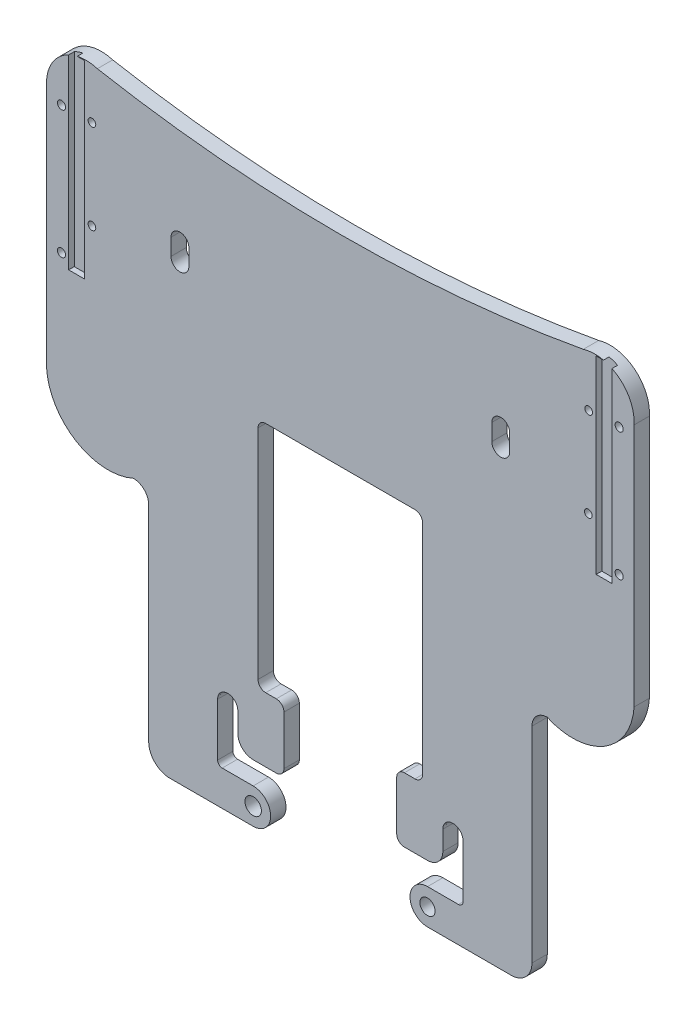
ISO-10303-21;
HEADER;
FILE_DESCRIPTION(('STEP AP214'),'2;1');
FILE_NAME('part.step','',(''),(''),'','','');
FILE_SCHEMA(('AUTOMOTIVE_DESIGN { 1 0 10303 214 1 1 1 1 }'));
ENDSEC;
DATA;
#1=APPLICATION_CONTEXT('core data for automotive mechanical design processes');
#2=APPLICATION_PROTOCOL_DEFINITION('international standard','automotive_design',2000,#1);
#3=PRODUCT_CONTEXT('',#1,'mechanical');
#4=PRODUCT('Part','Part','',(#3));
#5=PRODUCT_RELATED_PRODUCT_CATEGORY('part','',(#4));
#6=PRODUCT_DEFINITION_FORMATION('','',#4);
#7=PRODUCT_DEFINITION_CONTEXT('part definition',#1,'design');
#8=PRODUCT_DEFINITION('design','',#6,#7);
#9=PRODUCT_DEFINITION_SHAPE('','',#8);
#10=(LENGTH_UNIT() NAMED_UNIT(*) SI_UNIT(.MILLI.,.METRE.));
#11=(NAMED_UNIT(*) PLANE_ANGLE_UNIT() SI_UNIT($,.RADIAN.));
#12=(NAMED_UNIT(*) SI_UNIT($,.STERADIAN.) SOLID_ANGLE_UNIT());
#13=UNCERTAINTY_MEASURE_WITH_UNIT(LENGTH_MEASURE(1.E-05),#10,'distance_accuracy_value','');
#14=(GEOMETRIC_REPRESENTATION_CONTEXT(3) GLOBAL_UNCERTAINTY_ASSIGNED_CONTEXT((#13)) GLOBAL_UNIT_ASSIGNED_CONTEXT((#10,
#11,#12)) REPRESENTATION_CONTEXT('',''));
#15=CARTESIAN_POINT('',(0.,0.,0.));
#16=DIRECTION('',(0.,0.,1.));
#17=DIRECTION('',(1.,0.,0.));
#18=AXIS2_PLACEMENT_3D('',#15,#16,#17);
#19=CARTESIAN_POINT('',(150.06786242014,265.098361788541,6.));
#20=CARTESIAN_POINT('',(150.06786242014,267.281416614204,6.));
#21=CARTESIAN_POINT('',(151.837594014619,269.051488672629,6.));
#22=CARTESIAN_POINT('',(154.020819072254,269.051488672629,6.));
#23=B_SPLINE_CURVE_WITH_KNOTS('',3,(#19,#20,#21,#22),.UNSPECIFIED.,.F.,.F.,(4,4),(11.,12.),.UNSPECIFIED.);
#24=DIRECTION('',(0.,0.,-1.));
#25=VECTOR('',#24,1.);
#26=SURFACE_OF_LINEAR_EXTRUSION('',#23,#25);
#27=CARTESIAN_POINT('',(150.06786242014,265.098361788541,0.));
#28=CARTESIAN_POINT('',(150.06786242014,267.281416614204,0.));
#29=CARTESIAN_POINT('',(151.837594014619,269.051488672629,0.));
#30=CARTESIAN_POINT('',(154.020819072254,269.051488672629,0.));
#31=B_SPLINE_CURVE_WITH_KNOTS('',3,(#27,#28,#29,#30),.UNSPECIFIED.,.F.,.F.,(4,4),(11.,12.),.UNSPECIFIED.);
#32=CARTESIAN_POINT('',(150.06786242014,265.098361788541,0.));
#33=VERTEX_POINT('',#32);
#34=CARTESIAN_POINT('',(154.020819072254,269.051488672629,0.));
#35=VERTEX_POINT('',#34);
#36=EDGE_CURVE('E693',#33,#35,#31,.T.);
#37=ORIENTED_EDGE('',*,*,#36,.T.);
#38=DIRECTION('',(0.,0.,-1.));
#39=VECTOR('',#38,1.);
#40=CARTESIAN_POINT('',(154.020819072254,269.051488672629,6.));
#41=LINE('',#40,#39);
#42=CARTESIAN_POINT('',(154.020819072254,269.051488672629,6.));
#43=VERTEX_POINT('',#42);
#44=EDGE_CURVE('E951',#43,#35,#41,.T.);
#45=ORIENTED_EDGE('',*,*,#44,.F.);
#46=CARTESIAN_POINT('',(150.06786242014,265.098361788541,6.));
#47=VERTEX_POINT('',#46);
#48=EDGE_CURVE('E592',#47,#43,#23,.T.);
#49=ORIENTED_EDGE('',*,*,#48,.F.);
#50=DIRECTION('',(0.,0.,-1.));
#51=VECTOR('',#50,1.);
#52=CARTESIAN_POINT('',(150.06786242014,265.098361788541,6.));
#53=LINE('',#52,#51);
#54=EDGE_CURVE('E843',#47,#33,#53,.T.);
#55=ORIENTED_EDGE('',*,*,#54,.T.);
#56=EDGE_LOOP('',(#37,#45,#49,#55));
#57=FACE_BOUND('',#56,.T.);
#58=ADVANCED_FACE('F36',(#57),#26,.F.);
#59=CARTESIAN_POINT('',(154.020819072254,269.051488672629,6.));
#60=CARTESIAN_POINT('',(156.202113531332,269.051488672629,6.));
#61=CARTESIAN_POINT('',(157.97028017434,267.282981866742,6.));
#62=CARTESIAN_POINT('',(157.97028017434,265.101857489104,6.));
#63=B_SPLINE_CURVE_WITH_KNOTS('',3,(#59,#60,#61,#62),.UNSPECIFIED.,.F.,.F.,(4,4),(12.,13.),.UNSPECIFIED.);
#64=DIRECTION('',(0.,0.,-1.));
#65=VECTOR('',#64,1.);
#66=SURFACE_OF_LINEAR_EXTRUSION('',#63,#65);
#67=CARTESIAN_POINT('',(154.020819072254,269.051488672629,0.));
#68=CARTESIAN_POINT('',(156.202113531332,269.051488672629,0.));
#69=CARTESIAN_POINT('',(157.97028017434,267.282981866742,0.));
#70=CARTESIAN_POINT('',(157.97028017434,265.101857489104,0.));
#71=B_SPLINE_CURVE_WITH_KNOTS('',3,(#67,#68,#69,#70),.UNSPECIFIED.,.F.,.F.,(4,4),(12.,13.),.UNSPECIFIED.);
#72=CARTESIAN_POINT('',(157.97028017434,265.101857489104,0.));
#73=VERTEX_POINT('',#72);
#74=EDGE_CURVE('E698',#35,#73,#71,.T.);
#75=ORIENTED_EDGE('',*,*,#74,.T.);
#76=DIRECTION('',(0.,0.,-1.));
#77=VECTOR('',#76,1.);
#78=CARTESIAN_POINT('',(157.97028017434,265.101857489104,6.));
#79=LINE('',#78,#77);
#80=CARTESIAN_POINT('',(157.97028017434,265.101857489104,6.));
#81=VERTEX_POINT('',#80);
#82=EDGE_CURVE('E948',#81,#73,#79,.T.);
#83=ORIENTED_EDGE('',*,*,#82,.F.);
#84=EDGE_CURVE('E598',#43,#81,#63,.T.);
#85=ORIENTED_EDGE('',*,*,#84,.F.);
#86=ORIENTED_EDGE('',*,*,#44,.T.);
#87=EDGE_LOOP('',(#75,#83,#85,#86));
#88=FACE_BOUND('',#87,.T.);
#89=ADVANCED_FACE('F610',(#88),#66,.F.);
#90=CARTESIAN_POINT('',(157.97028017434,0.,6.));
#91=DIRECTION('',(1.,0.,0.));
#92=DIRECTION('',(0.,0.,-1.));
#93=AXIS2_PLACEMENT_3D('',#90,#91,#92);
#94=PLANE('',#93);
#95=DIRECTION('',(0.,-1.,0.));
#96=VECTOR('',#95,1.);
#97=CARTESIAN_POINT('',(157.97028017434,0.,0.));
#98=LINE('',#97,#96);
#99=CARTESIAN_POINT('',(157.97028017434,257.52504560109,0.));
#100=VERTEX_POINT('',#99);
#101=EDGE_CURVE('E705',#73,#100,#98,.T.);
#102=ORIENTED_EDGE('',*,*,#101,.T.);
#103=DIRECTION('',(0.,0.,-1.));
#104=VECTOR('',#103,1.);
#105=CARTESIAN_POINT('',(157.97028017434,257.52504560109,6.));
#106=LINE('',#105,#104);
#107=CARTESIAN_POINT('',(157.97028017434,257.52504560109,6.));
#108=VERTEX_POINT('',#107);
#109=EDGE_CURVE('E946',#108,#100,#106,.T.);
#110=ORIENTED_EDGE('',*,*,#109,.F.);
#111=DIRECTION('',(0.,-1.,0.));
#112=VECTOR('',#111,1.);
#113=CARTESIAN_POINT('',(157.97028017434,0.,6.));
#114=LINE('',#113,#112);
#115=EDGE_CURVE('E1094',#81,#108,#114,.T.);
#116=ORIENTED_EDGE('',*,*,#115,.F.);
#117=ORIENTED_EDGE('',*,*,#82,.T.);
#118=EDGE_LOOP('',(#102,#110,#116,#117));
#119=FACE_BOUND('',#118,.T.);
#120=ADVANCED_FACE('F1248',(#119),#94,.F.);
#121=CARTESIAN_POINT('',(163.97028017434,257.52504560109,6.));
#122=DIRECTION('',(0.,0.,-1.));
#123=DIRECTION('',(-1.,0.,0.));
#124=AXIS2_PLACEMENT_3D('',#121,#122,#123);
#125=CYLINDRICAL_SURFACE('',#124,6.00000000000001);
#126=CARTESIAN_POINT('',(163.97028017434,257.52504560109,0.));
#127=DIRECTION('',(0.,0.,1.));
#128=DIRECTION('',(1.,0.,0.));
#129=AXIS2_PLACEMENT_3D('',#126,#127,#128);
#130=CIRCLE('',#129,6.00000000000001);
#131=CARTESIAN_POINT('',(163.97028017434,251.52504560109,0.));
#132=VERTEX_POINT('',#131);
#133=EDGE_CURVE('E711',#132,#100,#130,.F.);
#134=ORIENTED_EDGE('',*,*,#133,.F.);
#135=DIRECTION('',(0.,0.,-1.));
#136=VECTOR('',#135,1.);
#137=CARTESIAN_POINT('',(163.97028017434,251.52504560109,6.));
#138=LINE('',#137,#136);
#139=CARTESIAN_POINT('',(163.97028017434,251.52504560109,6.));
#140=VERTEX_POINT('',#139);
#141=EDGE_CURVE('E944',#140,#132,#138,.T.);
#142=ORIENTED_EDGE('',*,*,#141,.F.);
#143=CARTESIAN_POINT('',(163.97028017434,257.52504560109,6.));
#144=DIRECTION('',(0.,0.,1.));
#145=DIRECTION('',(1.,0.,0.));
#146=AXIS2_PLACEMENT_3D('',#143,#144,#145);
#147=CIRCLE('',#146,6.00000000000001);
#148=EDGE_CURVE('E1095',#140,#108,#147,.F.);
#149=ORIENTED_EDGE('',*,*,#148,.T.);
#150=ORIENTED_EDGE('',*,*,#109,.T.);
#151=EDGE_LOOP('',(#134,#142,#149,#150));
#152=FACE_BOUND('',#151,.T.);
#153=ADVANCED_FACE('F1245',(#152),#125,.T.);
#154=CARTESIAN_POINT('',(0.,251.52504560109,6.));
#155=DIRECTION('',(0.,1.,0.));
#156=DIRECTION('',(0.,0.,1.));
#157=AXIS2_PLACEMENT_3D('',#154,#155,#156);
#158=PLANE('',#157);
#159=DIRECTION('',(1.,0.,0.));
#160=VECTOR('',#159,1.);
#161=CARTESIAN_POINT('',(0.,251.52504560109,0.));
#162=LINE('',#161,#160);
#163=CARTESIAN_POINT('',(173.01178720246,251.52504560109,0.));
#164=VERTEX_POINT('',#163);
#165=EDGE_CURVE('E714',#132,#164,#162,.T.);
#166=ORIENTED_EDGE('',*,*,#165,.T.);
#167=DIRECTION('',(0.,0.,-1.));
#168=VECTOR('',#167,1.);
#169=CARTESIAN_POINT('',(173.01178720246,251.52504560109,6.));
#170=LINE('',#169,#168);
#171=CARTESIAN_POINT('',(173.01178720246,251.52504560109,6.));
#172=VERTEX_POINT('',#171);
#173=EDGE_CURVE('E942',#172,#164,#170,.T.);
#174=ORIENTED_EDGE('',*,*,#173,.F.);
#175=DIRECTION('',(1.,0.,0.));
#176=VECTOR('',#175,1.);
#177=CARTESIAN_POINT('',(0.,251.52504560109,6.));
#178=LINE('',#177,#176);
#179=EDGE_CURVE('E1099',#140,#172,#178,.T.);
#180=ORIENTED_EDGE('',*,*,#179,.F.);
#181=ORIENTED_EDGE('',*,*,#141,.T.);
#182=EDGE_LOOP('',(#166,#174,#180,#181));
#183=FACE_BOUND('',#182,.T.);
#184=ADVANCED_FACE('F1241',(#183),#158,.F.);
#185=CARTESIAN_POINT('',(173.01178720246,254.52504560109,6.));
#186=DIRECTION('',(0.,0.,-1.));
#187=DIRECTION('',(-1.,0.,0.));
#188=AXIS2_PLACEMENT_3D('',#185,#186,#187);
#189=CYLINDRICAL_SURFACE('',#188,3.00000000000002);
#190=CARTESIAN_POINT('',(173.01178720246,254.52504560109,0.));
#191=DIRECTION('',(0.,0.,1.));
#192=DIRECTION('',(1.,0.,0.));
#193=AXIS2_PLACEMENT_3D('',#190,#191,#192);
#194=CIRCLE('',#193,3.00000000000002);
#195=CARTESIAN_POINT('',(176.01178720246,254.52504560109,0.));
#196=VERTEX_POINT('',#195);
#197=EDGE_CURVE('E717',#196,#164,#194,.F.);
#198=ORIENTED_EDGE('',*,*,#197,.F.);
#199=DIRECTION('',(0.,0.,-1.));
#200=VECTOR('',#199,1.);
#201=CARTESIAN_POINT('',(176.01178720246,254.52504560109,6.));
#202=LINE('',#201,#200);
#203=CARTESIAN_POINT('',(176.01178720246,254.52504560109,6.));
#204=VERTEX_POINT('',#203);
#205=EDGE_CURVE('E940',#204,#196,#202,.T.);
#206=ORIENTED_EDGE('',*,*,#205,.F.);
#207=CARTESIAN_POINT('',(173.01178720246,254.52504560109,6.));
#208=DIRECTION('',(0.,0.,1.));
#209=DIRECTION('',(1.,0.,0.));
#210=AXIS2_PLACEMENT_3D('',#207,#208,#209);
#211=CIRCLE('',#210,3.00000000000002);
#212=EDGE_CURVE('E1103',#204,#172,#211,.F.);
#213=ORIENTED_EDGE('',*,*,#212,.T.);
#214=ORIENTED_EDGE('',*,*,#173,.T.);
#215=EDGE_LOOP('',(#198,#206,#213,#214));
#216=FACE_BOUND('',#215,.T.);
#217=ADVANCED_FACE('F1237',(#216),#189,.T.);
#218=CARTESIAN_POINT('',(176.01178720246,0.,6.));
#219=DIRECTION('',(1.,0.,0.));
#220=DIRECTION('',(0.,0.,-1.));
#221=AXIS2_PLACEMENT_3D('',#218,#219,#220);
#222=PLANE('',#221);
#223=DIRECTION('',(0.,-1.,0.));
#224=VECTOR('',#223,1.);
#225=CARTESIAN_POINT('',(176.01178720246,0.,0.));
#226=LINE('',#225,#224);
#227=CARTESIAN_POINT('',(176.01178720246,273.688447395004,0.));
#228=VERTEX_POINT('',#227);
#229=EDGE_CURVE('E720',#228,#196,#226,.T.);
#230=ORIENTED_EDGE('',*,*,#229,.F.);
#231=DIRECTION('',(0.,0.,-1.));
#232=VECTOR('',#231,1.);
#233=CARTESIAN_POINT('',(176.01178720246,273.688447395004,6.));
#234=LINE('',#233,#232);
#235=CARTESIAN_POINT('',(176.01178720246,273.688447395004,6.));
#236=VERTEX_POINT('',#235);
#237=EDGE_CURVE('E938',#236,#228,#234,.T.);
#238=ORIENTED_EDGE('',*,*,#237,.F.);
#239=DIRECTION('',(0.,-1.,0.));
#240=VECTOR('',#239,1.);
#241=CARTESIAN_POINT('',(176.01178720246,0.,6.));
#242=LINE('',#241,#240);
#243=EDGE_CURVE('E1106',#236,#204,#242,.T.);
#244=ORIENTED_EDGE('',*,*,#243,.T.);
#245=ORIENTED_EDGE('',*,*,#205,.T.);
#246=EDGE_LOOP('',(#230,#238,#244,#245));
#247=FACE_BOUND('',#246,.T.);
#248=ADVANCED_FACE('F1233',(#247),#222,.T.);
#249=CARTESIAN_POINT('',(173.01178720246,273.688447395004,6.));
#250=DIRECTION('',(0.,0.,-1.));
#251=DIRECTION('',(-1.,0.,0.));
#252=AXIS2_PLACEMENT_3D('',#249,#250,#251);
#253=CYLINDRICAL_SURFACE('',#252,3.);
#254=CARTESIAN_POINT('',(173.01178720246,273.688447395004,0.));
#255=DIRECTION('',(0.,0.,1.));
#256=DIRECTION('',(1.,0.,0.));
#257=AXIS2_PLACEMENT_3D('',#254,#255,#256);
#258=CIRCLE('',#257,3.);
#259=CARTESIAN_POINT('',(173.01178720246,276.688447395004,0.));
#260=VERTEX_POINT('',#259);
#261=EDGE_CURVE('E723',#228,#260,#258,.T.);
#262=ORIENTED_EDGE('',*,*,#261,.T.);
#263=DIRECTION('',(0.,0.,-1.));
#264=VECTOR('',#263,1.);
#265=CARTESIAN_POINT('',(173.01178720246,276.688447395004,6.));
#266=LINE('',#265,#264);
#267=CARTESIAN_POINT('',(173.01178720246,276.688447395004,6.));
#268=VERTEX_POINT('',#267);
#269=EDGE_CURVE('E935',#268,#260,#266,.T.);
#270=ORIENTED_EDGE('',*,*,#269,.F.);
#271=CARTESIAN_POINT('',(173.01178720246,273.688447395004,6.));
#272=DIRECTION('',(0.,0.,1.));
#273=DIRECTION('',(1.,0.,0.));
#274=AXIS2_PLACEMENT_3D('',#271,#272,#273);
#275=CIRCLE('',#274,3.);
#276=EDGE_CURVE('E1109',#236,#268,#275,.T.);
#277=ORIENTED_EDGE('',*,*,#276,.F.);
#278=ORIENTED_EDGE('',*,*,#237,.T.);
#279=EDGE_LOOP('',(#262,#270,#277,#278));
#280=FACE_BOUND('',#279,.T.);
#281=ADVANCED_FACE('F1229',(#280),#253,.T.);
#282=CARTESIAN_POINT('',(0.,276.688447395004,6.));
#283=DIRECTION('',(0.,-1.,0.));
#284=DIRECTION('',(0.,0.,-1.));
#285=AXIS2_PLACEMENT_3D('',#282,#283,#284);
#286=PLANE('',#285);
#287=DIRECTION('',(-1.,0.,0.));
#288=VECTOR('',#287,1.);
#289=CARTESIAN_POINT('',(0.,276.688447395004,0.));
#290=LINE('',#289,#288);
#291=CARTESIAN_POINT('',(168.873871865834,276.688447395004,0.));
#292=VERTEX_POINT('',#291);
#293=EDGE_CURVE('E725',#260,#292,#290,.T.);
#294=ORIENTED_EDGE('',*,*,#293,.T.);
#295=DIRECTION('',(0.,0.,-1.));
#296=VECTOR('',#295,1.);
#297=CARTESIAN_POINT('',(168.873871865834,276.688447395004,6.));
#298=LINE('',#297,#296);
#299=CARTESIAN_POINT('',(168.873871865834,276.688447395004,6.));
#300=VERTEX_POINT('',#299);
#301=EDGE_CURVE('E933',#300,#292,#298,.T.);
#302=ORIENTED_EDGE('',*,*,#301,.F.);
#303=DIRECTION('',(-1.,0.,0.));
#304=VECTOR('',#303,1.);
#305=CARTESIAN_POINT('',(0.,276.688447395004,6.));
#306=LINE('',#305,#304);
#307=EDGE_CURVE('E1111',#268,#300,#306,.T.);
#308=ORIENTED_EDGE('',*,*,#307,.F.);
#309=ORIENTED_EDGE('',*,*,#269,.T.);
#310=EDGE_LOOP('',(#294,#302,#308,#309));
#311=FACE_BOUND('',#310,.T.);
#312=ADVANCED_FACE('F1225',(#311),#286,.F.);
#313=CARTESIAN_POINT('',(168.873871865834,279.688447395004,6.));
#314=DIRECTION('',(0.,0.,-1.));
#315=DIRECTION('',(-1.,0.,0.));
#316=AXIS2_PLACEMENT_3D('',#313,#314,#315);
#317=CYLINDRICAL_SURFACE('',#316,2.99999999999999);
#318=CARTESIAN_POINT('',(168.873871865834,279.688447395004,0.));
#319=DIRECTION('',(0.,0.,1.));
#320=DIRECTION('',(1.,0.,0.));
#321=AXIS2_PLACEMENT_3D('',#318,#319,#320);
#322=CIRCLE('',#321,2.99999999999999);
#323=CARTESIAN_POINT('',(165.873871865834,279.688447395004,0.));
#324=VERTEX_POINT('',#323);
#325=EDGE_CURVE('E728',#324,#292,#322,.T.);
#326=ORIENTED_EDGE('',*,*,#325,.F.);
#327=DIRECTION('',(0.,0.,-1.));
#328=VECTOR('',#327,1.);
#329=CARTESIAN_POINT('',(165.873871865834,279.688447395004,6.));
#330=LINE('',#329,#328);
#331=CARTESIAN_POINT('',(165.873871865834,279.688447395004,6.));
#332=VERTEX_POINT('',#331);
#333=EDGE_CURVE('E931',#332,#324,#330,.T.);
#334=ORIENTED_EDGE('',*,*,#333,.F.);
#335=CARTESIAN_POINT('',(168.873871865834,279.688447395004,6.));
#336=DIRECTION('',(0.,0.,1.));
#337=DIRECTION('',(1.,0.,0.));
#338=AXIS2_PLACEMENT_3D('',#335,#336,#337);
#339=CIRCLE('',#338,2.99999999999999);
#340=EDGE_CURVE('E1113',#332,#300,#339,.T.);
#341=ORIENTED_EDGE('',*,*,#340,.T.);
#342=ORIENTED_EDGE('',*,*,#301,.T.);
#343=EDGE_LOOP('',(#326,#334,#341,#342));
#344=FACE_BOUND('',#343,.T.);
#345=ADVANCED_FACE('F1221',(#344),#317,.F.);
#346=CARTESIAN_POINT('',(165.873871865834,0.,6.));
#347=DIRECTION('',(-1.,0.,0.));
#348=DIRECTION('',(0.,0.,1.));
#349=AXIS2_PLACEMENT_3D('',#346,#347,#348);
#350=PLANE('',#349);
#351=DIRECTION('',(0.,1.,0.));
#352=VECTOR('',#351,1.);
#353=CARTESIAN_POINT('',(165.873871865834,0.,0.));
#354=LINE('',#353,#352);
#355=CARTESIAN_POINT('',(165.873871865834,364.87563582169,0.));
#356=VERTEX_POINT('',#355);
#357=EDGE_CURVE('E731',#324,#356,#354,.T.);
#358=ORIENTED_EDGE('',*,*,#357,.T.);
#359=DIRECTION('',(0.,0.,-1.));
#360=VECTOR('',#359,1.);
#361=CARTESIAN_POINT('',(165.873871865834,364.87563582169,6.));
#362=LINE('',#361,#360);
#363=CARTESIAN_POINT('',(165.873871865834,364.87563582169,6.));
#364=VERTEX_POINT('',#363);
#365=EDGE_CURVE('E928',#364,#356,#362,.T.);
#366=ORIENTED_EDGE('',*,*,#365,.F.);
#367=DIRECTION('',(0.,1.,0.));
#368=VECTOR('',#367,1.);
#369=CARTESIAN_POINT('',(165.873871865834,0.,6.));
#370=LINE('',#369,#368);
#371=EDGE_CURVE('E1116',#332,#364,#370,.T.);
#372=ORIENTED_EDGE('',*,*,#371,.F.);
#373=ORIENTED_EDGE('',*,*,#333,.T.);
#374=EDGE_LOOP('',(#358,#366,#372,#373));
#375=FACE_BOUND('',#374,.T.);
#376=ADVANCED_FACE('F1217',(#375),#350,.F.);
#377=CARTESIAN_POINT('',(168.873871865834,364.87563582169,6.));
#378=DIRECTION('',(0.,0.,-1.));
#379=DIRECTION('',(-1.,0.,0.));
#380=AXIS2_PLACEMENT_3D('',#377,#378,#379);
#381=CYLINDRICAL_SURFACE('',#380,2.99999999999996);
#382=CARTESIAN_POINT('',(168.873871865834,364.87563582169,0.));
#383=DIRECTION('',(0.,0.,1.));
#384=DIRECTION('',(1.,0.,0.));
#385=AXIS2_PLACEMENT_3D('',#382,#383,#384);
#386=CIRCLE('',#385,2.99999999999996);
#387=CARTESIAN_POINT('',(168.873871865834,367.87563582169,0.));
#388=VERTEX_POINT('',#387);
#389=EDGE_CURVE('E733',#356,#388,#386,.F.);
#390=ORIENTED_EDGE('',*,*,#389,.T.);
#391=DIRECTION('',(0.,0.,-1.));
#392=VECTOR('',#391,1.);
#393=CARTESIAN_POINT('',(168.873871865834,367.87563582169,6.));
#394=LINE('',#393,#392);
#395=CARTESIAN_POINT('',(168.873871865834,367.87563582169,6.));
#396=VERTEX_POINT('',#395);
#397=EDGE_CURVE('E925',#396,#388,#394,.T.);
#398=ORIENTED_EDGE('',*,*,#397,.F.);
#399=CARTESIAN_POINT('',(168.873871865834,364.87563582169,6.));
#400=DIRECTION('',(0.,0.,1.));
#401=DIRECTION('',(1.,0.,0.));
#402=AXIS2_PLACEMENT_3D('',#399,#400,#401);
#403=CIRCLE('',#402,2.99999999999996);
#404=EDGE_CURVE('E1118',#364,#396,#403,.F.);
#405=ORIENTED_EDGE('',*,*,#404,.F.);
#406=ORIENTED_EDGE('',*,*,#365,.T.);
#407=EDGE_LOOP('',(#390,#398,#405,#406));
#408=FACE_BOUND('',#407,.T.);
#409=ADVANCED_FACE('F1213',(#408),#381,.F.);
#410=CARTESIAN_POINT('',(0.,367.87563582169,6.));
#411=DIRECTION('',(0.,1.,0.));
#412=DIRECTION('',(0.,0.,1.));
#413=AXIS2_PLACEMENT_3D('',#410,#411,#412);
#414=PLANE('',#413);
#415=DIRECTION('',(1.,0.,0.));
#416=VECTOR('',#415,1.);
#417=CARTESIAN_POINT('',(0.,367.87563582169,0.));
#418=LINE('',#417,#416);
#419=CARTESIAN_POINT('',(227.236956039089,367.87563582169,0.));
#420=VERTEX_POINT('',#419);
#421=EDGE_CURVE('E735',#388,#420,#418,.T.);
#422=ORIENTED_EDGE('',*,*,#421,.T.);
#423=DIRECTION('',(0.,0.,-1.));
#424=VECTOR('',#423,1.);
#425=CARTESIAN_POINT('',(227.236956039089,367.87563582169,6.));
#426=LINE('',#425,#424);
#427=CARTESIAN_POINT('',(227.236956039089,367.87563582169,6.));
#428=VERTEX_POINT('',#427);
#429=EDGE_CURVE('E923',#428,#420,#426,.T.);
#430=ORIENTED_EDGE('',*,*,#429,.F.);
#431=DIRECTION('',(1.,0.,0.));
#432=VECTOR('',#431,1.);
#433=CARTESIAN_POINT('',(0.,367.87563582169,6.));
#434=LINE('',#433,#432);
#435=EDGE_CURVE('E1120',#396,#428,#434,.T.);
#436=ORIENTED_EDGE('',*,*,#435,.F.);
#437=ORIENTED_EDGE('',*,*,#397,.T.);
#438=EDGE_LOOP('',(#422,#430,#436,#437));
#439=FACE_BOUND('',#438,.T.);
#440=ADVANCED_FACE('F1209',(#439),#414,.F.);
#441=CARTESIAN_POINT('',(227.236956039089,364.87563582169,6.));
#442=DIRECTION('',(0.,0.,-1.));
#443=DIRECTION('',(-1.,0.,0.));
#444=AXIS2_PLACEMENT_3D('',#441,#442,#443);
#445=CYLINDRICAL_SURFACE('',#444,2.99999999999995);
#446=CARTESIAN_POINT('',(227.236956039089,364.87563582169,0.));
#447=DIRECTION('',(0.,0.,1.));
#448=DIRECTION('',(1.,0.,0.));
#449=AXIS2_PLACEMENT_3D('',#446,#447,#448);
#450=CIRCLE('',#449,2.99999999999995);
#451=CARTESIAN_POINT('',(230.236956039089,364.87563582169,0.));
#452=VERTEX_POINT('',#451);
#453=EDGE_CURVE('E738',#452,#420,#450,.T.);
#454=ORIENTED_EDGE('',*,*,#453,.F.);
#455=DIRECTION('',(0.,0.,-1.));
#456=VECTOR('',#455,1.);
#457=CARTESIAN_POINT('',(230.236956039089,364.87563582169,6.));
#458=LINE('',#457,#456);
#459=CARTESIAN_POINT('',(230.236956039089,364.87563582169,6.));
#460=VERTEX_POINT('',#459);
#461=EDGE_CURVE('E921',#460,#452,#458,.T.);
#462=ORIENTED_EDGE('',*,*,#461,.F.);
#463=CARTESIAN_POINT('',(227.236956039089,364.87563582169,6.));
#464=DIRECTION('',(0.,0.,1.));
#465=DIRECTION('',(1.,0.,0.));
#466=AXIS2_PLACEMENT_3D('',#463,#464,#465);
#467=CIRCLE('',#466,2.99999999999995);
#468=EDGE_CURVE('E1122',#460,#428,#467,.T.);
#469=ORIENTED_EDGE('',*,*,#468,.T.);
#470=ORIENTED_EDGE('',*,*,#429,.T.);
#471=EDGE_LOOP('',(#454,#462,#469,#470));
#472=FACE_BOUND('',#471,.T.);
#473=ADVANCED_FACE('F1205',(#472),#445,.F.);
#474=CARTESIAN_POINT('',(230.236956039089,1.50030993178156E-13,6.));
#475=DIRECTION('',(-1.,0.,0.));
#476=DIRECTION('',(0.,-1.,0.));
#477=AXIS2_PLACEMENT_3D('',#474,#475,#476);
#478=PLANE('',#477);
#479=DIRECTION('',(0.,1.,0.));
#480=VECTOR('',#479,1.);
#481=CARTESIAN_POINT('',(230.236956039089,1.50030993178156E-13,0.));
#482=LINE('',#481,#480);
#483=CARTESIAN_POINT('',(230.236956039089,279.688447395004,0.));
#484=VERTEX_POINT('',#483);
#485=EDGE_CURVE('E741',#484,#452,#482,.T.);
#486=ORIENTED_EDGE('',*,*,#485,.F.);
#487=DIRECTION('',(0.,0.,-1.));
#488=VECTOR('',#487,1.);
#489=CARTESIAN_POINT('',(230.236956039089,279.688447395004,6.));
#490=LINE('',#489,#488);
#491=CARTESIAN_POINT('',(230.236956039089,279.688447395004,6.));
#492=VERTEX_POINT('',#491);
#493=EDGE_CURVE('E919',#492,#484,#490,.T.);
#494=ORIENTED_EDGE('',*,*,#493,.F.);
#495=DIRECTION('',(0.,1.,0.));
#496=VECTOR('',#495,1.);
#497=CARTESIAN_POINT('',(230.236956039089,1.50030993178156E-13,6.));
#498=LINE('',#497,#496);
#499=EDGE_CURVE('E1125',#492,#460,#498,.T.);
#500=ORIENTED_EDGE('',*,*,#499,.T.);
#501=ORIENTED_EDGE('',*,*,#461,.T.);
#502=EDGE_LOOP('',(#486,#494,#500,#501));
#503=FACE_BOUND('',#502,.T.);
#504=ADVANCED_FACE('F1201',(#503),#478,.T.);
#505=CARTESIAN_POINT('',(227.236956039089,279.688447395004,6.));
#506=DIRECTION('',(0.,0.,-1.));
#507=DIRECTION('',(-1.,0.,0.));
#508=AXIS2_PLACEMENT_3D('',#505,#506,#507);
#509=CYLINDRICAL_SURFACE('',#508,3.);
#510=CARTESIAN_POINT('',(227.236956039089,279.688447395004,0.));
#511=DIRECTION('',(0.,0.,1.));
#512=DIRECTION('',(1.,0.,0.));
#513=AXIS2_PLACEMENT_3D('',#510,#511,#512);
#514=CIRCLE('',#513,3.);
#515=CARTESIAN_POINT('',(227.236956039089,276.688447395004,0.));
#516=VERTEX_POINT('',#515);
#517=EDGE_CURVE('E744',#484,#516,#514,.F.);
#518=ORIENTED_EDGE('',*,*,#517,.T.);
#519=DIRECTION('',(0.,0.,-1.));
#520=VECTOR('',#519,1.);
#521=CARTESIAN_POINT('',(227.236956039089,276.688447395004,6.));
#522=LINE('',#521,#520);
#523=CARTESIAN_POINT('',(227.236956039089,276.688447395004,6.));
#524=VERTEX_POINT('',#523);
#525=EDGE_CURVE('E917',#524,#516,#522,.T.);
#526=ORIENTED_EDGE('',*,*,#525,.F.);
#527=CARTESIAN_POINT('',(227.236956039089,279.688447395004,6.));
#528=DIRECTION('',(0.,0.,1.));
#529=DIRECTION('',(1.,0.,0.));
#530=AXIS2_PLACEMENT_3D('',#527,#528,#529);
#531=CIRCLE('',#530,3.);
#532=EDGE_CURVE('E1128',#492,#524,#531,.F.);
#533=ORIENTED_EDGE('',*,*,#532,.F.);
#534=ORIENTED_EDGE('',*,*,#493,.T.);
#535=EDGE_LOOP('',(#518,#526,#533,#534));
#536=FACE_BOUND('',#535,.T.);
#537=ADVANCED_FACE('F1197',(#536),#509,.F.);
#538=CARTESIAN_POINT('',(0.,276.688447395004,6.));
#539=DIRECTION('',(0.,1.,0.));
#540=DIRECTION('',(0.,0.,1.));
#541=AXIS2_PLACEMENT_3D('',#538,#539,#540);
#542=PLANE('',#541);
#543=DIRECTION('',(1.,0.,0.));
#544=VECTOR('',#543,1.);
#545=CARTESIAN_POINT('',(0.,276.688447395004,0.));
#546=LINE('',#545,#544);
#547=CARTESIAN_POINT('',(223.099040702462,276.688447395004,0.));
#548=VERTEX_POINT('',#547);
#549=EDGE_CURVE('E747',#548,#516,#546,.T.);
#550=ORIENTED_EDGE('',*,*,#549,.F.);
#551=DIRECTION('',(0.,0.,-1.));
#552=VECTOR('',#551,1.);
#553=CARTESIAN_POINT('',(223.099040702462,276.688447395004,6.));
#554=LINE('',#553,#552);
#555=CARTESIAN_POINT('',(223.099040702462,276.688447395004,6.));
#556=VERTEX_POINT('',#555);
#557=EDGE_CURVE('E915',#556,#548,#554,.T.);
#558=ORIENTED_EDGE('',*,*,#557,.F.);
#559=DIRECTION('',(1.,0.,0.));
#560=VECTOR('',#559,1.);
#561=CARTESIAN_POINT('',(0.,276.688447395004,6.));
#562=LINE('',#561,#560);
#563=EDGE_CURVE('E1130',#556,#524,#562,.T.);
#564=ORIENTED_EDGE('',*,*,#563,.T.);
#565=ORIENTED_EDGE('',*,*,#525,.T.);
#566=EDGE_LOOP('',(#550,#558,#564,#565));
#567=FACE_BOUND('',#566,.T.);
#568=ADVANCED_FACE('F1193',(#567),#542,.T.);
#569=CARTESIAN_POINT('',(223.099040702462,273.688447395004,6.));
#570=DIRECTION('',(0.,0.,-1.));
#571=DIRECTION('',(-1.,0.,0.));
#572=AXIS2_PLACEMENT_3D('',#569,#570,#571);
#573=CYLINDRICAL_SURFACE('',#572,3.);
#574=CARTESIAN_POINT('',(223.099040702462,273.688447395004,0.));
#575=DIRECTION('',(0.,0.,1.));
#576=DIRECTION('',(1.,0.,0.));
#577=AXIS2_PLACEMENT_3D('',#574,#575,#576);
#578=CIRCLE('',#577,3.);
#579=CARTESIAN_POINT('',(220.099040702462,273.688447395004,0.));
#580=VERTEX_POINT('',#579);
#581=EDGE_CURVE('E750',#580,#548,#578,.F.);
#582=ORIENTED_EDGE('',*,*,#581,.F.);
#583=DIRECTION('',(0.,0.,-1.));
#584=VECTOR('',#583,1.);
#585=CARTESIAN_POINT('',(220.099040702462,273.688447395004,6.));
#586=LINE('',#585,#584);
#587=CARTESIAN_POINT('',(220.099040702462,273.688447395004,6.));
#588=VERTEX_POINT('',#587);
#589=EDGE_CURVE('E913',#588,#580,#586,.T.);
#590=ORIENTED_EDGE('',*,*,#589,.F.);
#591=CARTESIAN_POINT('',(223.099040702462,273.688447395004,6.));
#592=DIRECTION('',(0.,0.,1.));
#593=DIRECTION('',(1.,0.,0.));
#594=AXIS2_PLACEMENT_3D('',#591,#592,#593);
#595=CIRCLE('',#594,3.);
#596=EDGE_CURVE('E1133',#588,#556,#595,.F.);
#597=ORIENTED_EDGE('',*,*,#596,.T.);
#598=ORIENTED_EDGE('',*,*,#557,.T.);
#599=EDGE_LOOP('',(#582,#590,#597,#598));
#600=FACE_BOUND('',#599,.T.);
#601=ADVANCED_FACE('F1189',(#600),#573,.T.);
#602=CARTESIAN_POINT('',(220.099040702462,0.,6.));
#603=DIRECTION('',(1.,0.,0.));
#604=DIRECTION('',(0.,0.,-1.));
#605=AXIS2_PLACEMENT_3D('',#602,#603,#604);
#606=PLANE('',#605);
#607=DIRECTION('',(0.,-1.,0.));
#608=VECTOR('',#607,1.);
#609=CARTESIAN_POINT('',(220.099040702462,0.,0.));
#610=LINE('',#609,#608);
#611=CARTESIAN_POINT('',(220.099040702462,254.52504560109,0.));
#612=VERTEX_POINT('',#611);
#613=EDGE_CURVE('E753',#580,#612,#610,.T.);
#614=ORIENTED_EDGE('',*,*,#613,.T.);
#615=DIRECTION('',(0.,0.,-1.));
#616=VECTOR('',#615,1.);
#617=CARTESIAN_POINT('',(220.099040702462,254.52504560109,6.));
#618=LINE('',#617,#616);
#619=CARTESIAN_POINT('',(220.099040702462,254.52504560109,6.));
#620=VERTEX_POINT('',#619);
#621=EDGE_CURVE('E910',#620,#612,#618,.T.);
#622=ORIENTED_EDGE('',*,*,#621,.F.);
#623=DIRECTION('',(0.,-1.,0.));
#624=VECTOR('',#623,1.);
#625=CARTESIAN_POINT('',(220.099040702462,0.,6.));
#626=LINE('',#625,#624);
#627=EDGE_CURVE('E1136',#588,#620,#626,.T.);
#628=ORIENTED_EDGE('',*,*,#627,.F.);
#629=ORIENTED_EDGE('',*,*,#589,.T.);
#630=EDGE_LOOP('',(#614,#622,#628,#629));
#631=FACE_BOUND('',#630,.T.);
#632=ADVANCED_FACE('F1185',(#631),#606,.F.);
#633=CARTESIAN_POINT('',(223.099040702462,254.52504560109,6.));
#634=DIRECTION('',(0.,0.,-1.));
#635=DIRECTION('',(-1.,0.,0.));
#636=AXIS2_PLACEMENT_3D('',#633,#634,#635);
#637=CYLINDRICAL_SURFACE('',#636,3.00000000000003);
#638=CARTESIAN_POINT('',(223.099040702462,254.52504560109,0.));
#639=DIRECTION('',(0.,0.,1.));
#640=DIRECTION('',(1.,0.,0.));
#641=AXIS2_PLACEMENT_3D('',#638,#639,#640);
#642=CIRCLE('',#641,3.00000000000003);
#643=CARTESIAN_POINT('',(223.099040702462,251.52504560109,0.));
#644=VERTEX_POINT('',#643);
#645=EDGE_CURVE('E755',#612,#644,#642,.T.);
#646=ORIENTED_EDGE('',*,*,#645,.T.);
#647=DIRECTION('',(0.,0.,-1.));
#648=VECTOR('',#647,1.);
#649=CARTESIAN_POINT('',(223.099040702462,251.52504560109,6.));
#650=LINE('',#649,#648);
#651=CARTESIAN_POINT('',(223.099040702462,251.52504560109,6.));
#652=VERTEX_POINT('',#651);
#653=EDGE_CURVE('E908',#652,#644,#650,.T.);
#654=ORIENTED_EDGE('',*,*,#653,.F.);
#655=CARTESIAN_POINT('',(223.099040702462,254.52504560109,6.));
#656=DIRECTION('',(0.,0.,1.));
#657=DIRECTION('',(1.,0.,0.));
#658=AXIS2_PLACEMENT_3D('',#655,#656,#657);
#659=CIRCLE('',#658,3.00000000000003);
#660=EDGE_CURVE('E1138',#620,#652,#659,.T.);
#661=ORIENTED_EDGE('',*,*,#660,.F.);
#662=ORIENTED_EDGE('',*,*,#621,.T.);
#663=EDGE_LOOP('',(#646,#654,#661,#662));
#664=FACE_BOUND('',#663,.T.);
#665=ADVANCED_FACE('F1181',(#664),#637,.T.);
#666=CARTESIAN_POINT('',(0.,251.52504560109,6.));
#667=DIRECTION('',(0.,-1.,0.));
#668=DIRECTION('',(0.,0.,-1.));
#669=AXIS2_PLACEMENT_3D('',#666,#667,#668);
#670=PLANE('',#669);
#671=DIRECTION('',(-1.,0.,0.));
#672=VECTOR('',#671,1.);
#673=CARTESIAN_POINT('',(0.,251.52504560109,0.));
#674=LINE('',#673,#672);
#675=CARTESIAN_POINT('',(232.140547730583,251.52504560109,0.));
#676=VERTEX_POINT('',#675);
#677=EDGE_CURVE('E758',#676,#644,#674,.T.);
#678=ORIENTED_EDGE('',*,*,#677,.F.);
#679=DIRECTION('',(0.,0.,-1.));
#680=VECTOR('',#679,1.);
#681=CARTESIAN_POINT('',(232.140547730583,251.52504560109,6.));
#682=LINE('',#681,#680);
#683=CARTESIAN_POINT('',(232.140547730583,251.52504560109,6.));
#684=VERTEX_POINT('',#683);
#685=EDGE_CURVE('E906',#684,#676,#682,.T.);
#686=ORIENTED_EDGE('',*,*,#685,.F.);
#687=DIRECTION('',(-1.,0.,0.));
#688=VECTOR('',#687,1.);
#689=CARTESIAN_POINT('',(0.,251.52504560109,6.));
#690=LINE('',#689,#688);
#691=EDGE_CURVE('E1140',#684,#652,#690,.T.);
#692=ORIENTED_EDGE('',*,*,#691,.T.);
#693=ORIENTED_EDGE('',*,*,#653,.T.);
#694=EDGE_LOOP('',(#678,#686,#692,#693));
#695=FACE_BOUND('',#694,.T.);
#696=ADVANCED_FACE('F1177',(#695),#670,.T.);
#697=CARTESIAN_POINT('',(232.140547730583,257.52504560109,6.));
#698=DIRECTION('',(0.,0.,-1.));
#699=DIRECTION('',(-1.,0.,0.));
#700=AXIS2_PLACEMENT_3D('',#697,#698,#699);
#701=CYLINDRICAL_SURFACE('',#700,6.00000000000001);
#702=CARTESIAN_POINT('',(232.140547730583,257.52504560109,0.));
#703=DIRECTION('',(0.,0.,1.));
#704=DIRECTION('',(1.,0.,0.));
#705=AXIS2_PLACEMENT_3D('',#702,#703,#704);
#706=CIRCLE('',#705,6.00000000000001);
#707=CARTESIAN_POINT('',(238.140547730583,257.52504560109,0.));
#708=VERTEX_POINT('',#707);
#709=EDGE_CURVE('E761',#676,#708,#706,.T.);
#710=ORIENTED_EDGE('',*,*,#709,.T.);
#711=DIRECTION('',(0.,0.,-1.));
#712=VECTOR('',#711,1.);
#713=CARTESIAN_POINT('',(238.140547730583,257.52504560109,6.));
#714=LINE('',#713,#712);
#715=CARTESIAN_POINT('',(238.140547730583,257.52504560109,6.));
#716=VERTEX_POINT('',#715);
#717=EDGE_CURVE('E904',#716,#708,#714,.T.);
#718=ORIENTED_EDGE('',*,*,#717,.F.);
#719=CARTESIAN_POINT('',(232.140547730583,257.52504560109,6.));
#720=DIRECTION('',(0.,0.,1.));
#721=DIRECTION('',(1.,0.,0.));
#722=AXIS2_PLACEMENT_3D('',#719,#720,#721);
#723=CIRCLE('',#722,6.00000000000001);
#724=EDGE_CURVE('E1143',#684,#716,#723,.T.);
#725=ORIENTED_EDGE('',*,*,#724,.F.);
#726=ORIENTED_EDGE('',*,*,#685,.T.);
#727=EDGE_LOOP('',(#710,#718,#725,#726));
#728=FACE_BOUND('',#727,.T.);
#729=ADVANCED_FACE('F1173',(#728),#701,.T.);
#730=CARTESIAN_POINT('',(238.140547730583,0.,6.));
#731=DIRECTION('',(1.,0.,0.));
#732=DIRECTION('',(0.,0.,-1.));
#733=AXIS2_PLACEMENT_3D('',#730,#731,#732);
#734=PLANE('',#733);
#735=DIRECTION('',(0.,-1.,0.));
#736=VECTOR('',#735,1.);
#737=CARTESIAN_POINT('',(238.140547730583,0.,0.));
#738=LINE('',#737,#736);
#739=CARTESIAN_POINT('',(238.140547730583,265.101857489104,0.));
#740=VERTEX_POINT('',#739);
#741=EDGE_CURVE('E764',#740,#708,#738,.T.);
#742=ORIENTED_EDGE('',*,*,#741,.F.);
#743=DIRECTION('',(0.,0.,-1.));
#744=VECTOR('',#743,1.);
#745=CARTESIAN_POINT('',(238.140547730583,265.101857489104,6.));
#746=LINE('',#745,#744);
#747=CARTESIAN_POINT('',(238.140547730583,265.101857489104,6.));
#748=VERTEX_POINT('',#747);
#749=EDGE_CURVE('E902',#748,#740,#746,.T.);
#750=ORIENTED_EDGE('',*,*,#749,.F.);
#751=DIRECTION('',(0.,-1.,0.));
#752=VECTOR('',#751,1.);
#753=CARTESIAN_POINT('',(238.140547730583,0.,6.));
#754=LINE('',#753,#752);
#755=EDGE_CURVE('E1145',#748,#716,#754,.T.);
#756=ORIENTED_EDGE('',*,*,#755,.T.);
#757=ORIENTED_EDGE('',*,*,#717,.T.);
#758=EDGE_LOOP('',(#742,#750,#756,#757));
#759=FACE_BOUND('',#758,.T.);
#760=ADVANCED_FACE('F1168',(#759),#734,.T.);
#761=CARTESIAN_POINT('',(242.090008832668,269.051488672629,6.));
#762=CARTESIAN_POINT('',(239.90871437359,269.051488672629,6.));
#763=CARTESIAN_POINT('',(238.140547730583,267.282981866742,6.));
#764=CARTESIAN_POINT('',(238.140547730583,265.101857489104,6.));
#765=B_SPLINE_CURVE_WITH_KNOTS('',3,(#761,#762,#763,#764),.UNSPECIFIED.,.F.,.F.,(4,4),(12.,13.),.UNSPECIFIED.);
#766=DIRECTION('',(0.,0.,-1.));
#767=VECTOR('',#766,1.);
#768=SURFACE_OF_LINEAR_EXTRUSION('',#765,#767);
#769=CARTESIAN_POINT('',(242.090008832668,269.051488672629,0.));
#770=CARTESIAN_POINT('',(239.90871437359,269.051488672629,0.));
#771=CARTESIAN_POINT('',(238.140547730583,267.282981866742,0.));
#772=CARTESIAN_POINT('',(238.140547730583,265.101857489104,0.));
#773=B_SPLINE_CURVE_WITH_KNOTS('',3,(#769,#770,#771,#772),.UNSPECIFIED.,.F.,.F.,(4,4),(12.,13.),.UNSPECIFIED.);
#774=CARTESIAN_POINT('',(242.090008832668,269.051488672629,0.));
#775=VERTEX_POINT('',#774);
#776=EDGE_CURVE('E767',#775,#740,#773,.T.);
#777=ORIENTED_EDGE('',*,*,#776,.F.);
#778=DIRECTION('',(0.,0.,-1.));
#779=VECTOR('',#778,1.);
#780=CARTESIAN_POINT('',(242.090008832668,269.051488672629,6.));
#781=LINE('',#780,#779);
#782=CARTESIAN_POINT('',(242.090008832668,269.051488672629,6.));
#783=VERTEX_POINT('',#782);
#784=EDGE_CURVE('E900',#783,#775,#781,.T.);
#785=ORIENTED_EDGE('',*,*,#784,.F.);
#786=EDGE_CURVE('E1148',#783,#748,#765,.T.);
#787=ORIENTED_EDGE('',*,*,#786,.T.);
#788=ORIENTED_EDGE('',*,*,#749,.T.);
#789=EDGE_LOOP('',(#777,#785,#787,#788));
#790=FACE_BOUND('',#789,.T.);
#791=ADVANCED_FACE('F1163',(#790),#768,.T.);
#792=CARTESIAN_POINT('',(246.042965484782,265.098361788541,6.));
#793=CARTESIAN_POINT('',(246.042965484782,267.281416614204,6.));
#794=CARTESIAN_POINT('',(244.273233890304,269.051488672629,6.));
#795=CARTESIAN_POINT('',(242.090008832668,269.051488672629,6.));
#796=B_SPLINE_CURVE_WITH_KNOTS('',3,(#792,#793,#794,#795),.UNSPECIFIED.,.F.,.F.,(4,4),(11.,12.),.UNSPECIFIED.);
#797=DIRECTION('',(0.,0.,-1.));
#798=VECTOR('',#797,1.);
#799=SURFACE_OF_LINEAR_EXTRUSION('',#796,#798);
#800=CARTESIAN_POINT('',(246.042965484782,265.098361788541,0.));
#801=CARTESIAN_POINT('',(246.042965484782,267.281416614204,0.));
#802=CARTESIAN_POINT('',(244.273233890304,269.051488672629,0.));
#803=CARTESIAN_POINT('',(242.090008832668,269.051488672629,0.));
#804=B_SPLINE_CURVE_WITH_KNOTS('',3,(#800,#801,#802,#803),.UNSPECIFIED.,.F.,.F.,(4,4),(11.,12.),.UNSPECIFIED.);
#805=CARTESIAN_POINT('',(246.042965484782,265.098361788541,0.));
#806=VERTEX_POINT('',#805);
#807=EDGE_CURVE('E772',#806,#775,#804,.T.);
#808=ORIENTED_EDGE('',*,*,#807,.F.);
#809=DIRECTION('',(0.,0.,-1.));
#810=VECTOR('',#809,1.);
#811=CARTESIAN_POINT('',(246.042965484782,265.098361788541,6.));
#812=LINE('',#811,#810);
#813=CARTESIAN_POINT('',(246.042965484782,265.098361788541,6.));
#814=VERTEX_POINT('',#813);
#815=EDGE_CURVE('E898',#814,#806,#812,.T.);
#816=ORIENTED_EDGE('',*,*,#815,.F.);
#817=EDGE_CURVE('E1154',#814,#783,#796,.T.);
#818=ORIENTED_EDGE('',*,*,#817,.T.);
#819=ORIENTED_EDGE('',*,*,#784,.T.);
#820=EDGE_LOOP('',(#808,#816,#818,#819));
#821=FACE_BOUND('',#820,.T.);
#822=ADVANCED_FACE('F1167',(#821),#799,.T.);
#823=CARTESIAN_POINT('',(246.042965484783,3.31007368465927E-13,6.));
#824=DIRECTION('',(1.,0.,0.));
#825=DIRECTION('',(0.,1.,0.));
#826=AXIS2_PLACEMENT_3D('',#823,#824,#825);
#827=PLANE('',#826);
#828=DIRECTION('',(0.,-1.,0.));
#829=VECTOR('',#828,1.);
#830=CARTESIAN_POINT('',(246.042965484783,3.31007368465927E-13,0.));
#831=LINE('',#830,#829);
#832=CARTESIAN_POINT('',(246.042965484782,244.467207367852,0.));
#833=VERTEX_POINT('',#832);
#834=EDGE_CURVE('E780',#806,#833,#831,.T.);
#835=ORIENTED_EDGE('',*,*,#834,.T.);
#836=DIRECTION('',(0.,0.,-1.));
#837=VECTOR('',#836,1.);
#838=CARTESIAN_POINT('',(246.042965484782,244.467207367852,6.));
#839=LINE('',#838,#837);
#840=CARTESIAN_POINT('',(246.042965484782,244.467207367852,6.));
#841=VERTEX_POINT('',#840);
#842=EDGE_CURVE('E896',#841,#833,#839,.T.);
#843=ORIENTED_EDGE('',*,*,#842,.F.);
#844=DIRECTION('',(0.,-1.,0.));
#845=VECTOR('',#844,1.);
#846=CARTESIAN_POINT('',(246.042965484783,3.31007368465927E-13,6.));
#847=LINE('',#846,#845);
#848=EDGE_CURVE('E1311',#814,#841,#847,.T.);
#849=ORIENTED_EDGE('',*,*,#848,.F.);
#850=ORIENTED_EDGE('',*,*,#815,.T.);
#851=EDGE_LOOP('',(#835,#843,#849,#850));
#852=FACE_BOUND('',#851,.T.);
#853=ADVANCED_FACE('F1471',(#852),#827,.F.);
#854=CARTESIAN_POINT('',(244.242965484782,244.467207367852,6.));
#855=DIRECTION('',(0.,0.,-1.));
#856=DIRECTION('',(-1.,0.,0.));
#857=AXIS2_PLACEMENT_3D('',#854,#855,#856);
#858=CYLINDRICAL_SURFACE('',#857,1.8);
#859=CARTESIAN_POINT('',(244.242965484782,244.467207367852,0.));
#860=DIRECTION('',(0.,0.,1.));
#861=DIRECTION('',(1.,0.,0.));
#862=AXIS2_PLACEMENT_3D('',#859,#860,#861);
#863=CIRCLE('',#862,1.8);
#864=CARTESIAN_POINT('',(244.242965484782,242.667207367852,0.));
#865=VERTEX_POINT('',#864);
#866=EDGE_CURVE('E786',#865,#833,#863,.T.);
#867=ORIENTED_EDGE('',*,*,#866,.F.);
#868=DIRECTION('',(0.,0.,-1.));
#869=VECTOR('',#868,1.);
#870=CARTESIAN_POINT('',(244.242965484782,242.667207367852,6.));
#871=LINE('',#870,#869);
#872=CARTESIAN_POINT('',(244.242965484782,242.667207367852,6.));
#873=VERTEX_POINT('',#872);
#874=EDGE_CURVE('E894',#873,#865,#871,.T.);
#875=ORIENTED_EDGE('',*,*,#874,.F.);
#876=CARTESIAN_POINT('',(244.242965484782,244.467207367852,6.));
#877=DIRECTION('',(0.,0.,1.));
#878=DIRECTION('',(1.,0.,0.));
#879=AXIS2_PLACEMENT_3D('',#876,#877,#878);
#880=CIRCLE('',#879,1.8);
#881=EDGE_CURVE('E1312',#873,#841,#880,.T.);
#882=ORIENTED_EDGE('',*,*,#881,.T.);
#883=ORIENTED_EDGE('',*,*,#842,.T.);
#884=EDGE_LOOP('',(#867,#875,#882,#883));
#885=FACE_BOUND('',#884,.T.);
#886=ADVANCED_FACE('F1468',(#885),#858,.F.);
#887=CARTESIAN_POINT('',(0.,242.667207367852,6.));
#888=DIRECTION('',(0.,1.,0.));
#889=DIRECTION('',(0.,0.,1.));
#890=AXIS2_PLACEMENT_3D('',#887,#888,#889);
#891=PLANE('',#890);
#892=DIRECTION('',(1.,0.,0.));
#893=VECTOR('',#892,1.);
#894=CARTESIAN_POINT('',(0.,242.667207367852,0.));
#895=LINE('',#894,#893);
#896=CARTESIAN_POINT('',(232.140547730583,242.667207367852,0.));
#897=VERTEX_POINT('',#896);
#898=EDGE_CURVE('E789',#897,#865,#895,.T.);
#899=ORIENTED_EDGE('',*,*,#898,.F.);
#900=DIRECTION('',(0.,0.,-1.));
#901=VECTOR('',#900,1.);
#902=CARTESIAN_POINT('',(232.140547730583,242.667207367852,6.));
#903=LINE('',#902,#901);
#904=CARTESIAN_POINT('',(232.140547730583,242.667207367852,6.));
#905=VERTEX_POINT('',#904);
#906=EDGE_CURVE('E892',#905,#897,#903,.T.);
#907=ORIENTED_EDGE('',*,*,#906,.F.);
#908=DIRECTION('',(1.,0.,0.));
#909=VECTOR('',#908,1.);
#910=CARTESIAN_POINT('',(0.,242.667207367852,6.));
#911=LINE('',#910,#909);
#912=EDGE_CURVE('E1316',#905,#873,#911,.T.);
#913=ORIENTED_EDGE('',*,*,#912,.T.);
#914=ORIENTED_EDGE('',*,*,#874,.T.);
#915=EDGE_LOOP('',(#899,#907,#913,#914));
#916=FACE_BOUND('',#915,.T.);
#917=ADVANCED_FACE('F1464',(#916),#891,.T.);
#918=CARTESIAN_POINT('',(232.140547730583,235.826032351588,6.));
#919=DIRECTION('',(0.,0.,-1.));
#920=DIRECTION('',(-1.,0.,0.));
#921=AXIS2_PLACEMENT_3D('',#918,#919,#920);
#922=CYLINDRICAL_SURFACE('',#921,6.841175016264);
#923=CARTESIAN_POINT('',(232.140547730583,235.826032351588,0.));
#924=DIRECTION('',(0.,0.,1.));
#925=DIRECTION('',(1.,0.,0.));
#926=AXIS2_PLACEMENT_3D('',#923,#924,#925);
#927=CIRCLE('',#926,6.841175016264);
#928=CARTESIAN_POINT('',(232.140547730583,228.984857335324,0.));
#929=VERTEX_POINT('',#928);
#930=EDGE_CURVE('E792',#929,#897,#927,.F.);
#931=ORIENTED_EDGE('',*,*,#930,.F.);
#932=DIRECTION('',(0.,0.,-1.));
#933=VECTOR('',#932,1.);
#934=CARTESIAN_POINT('',(232.140547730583,228.984857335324,6.));
#935=LINE('',#934,#933);
#936=CARTESIAN_POINT('',(232.140547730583,228.984857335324,6.));
#937=VERTEX_POINT('',#936);
#938=EDGE_CURVE('E890',#937,#929,#935,.T.);
#939=ORIENTED_EDGE('',*,*,#938,.F.);
#940=CARTESIAN_POINT('',(232.140547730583,235.826032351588,6.));
#941=DIRECTION('',(0.,0.,1.));
#942=DIRECTION('',(1.,0.,0.));
#943=AXIS2_PLACEMENT_3D('',#940,#941,#942);
#944=CIRCLE('',#943,6.841175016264);
#945=EDGE_CURVE('E1321',#937,#905,#944,.F.);
#946=ORIENTED_EDGE('',*,*,#945,.T.);
#947=ORIENTED_EDGE('',*,*,#906,.T.);
#948=EDGE_LOOP('',(#931,#939,#946,#947));
#949=FACE_BOUND('',#948,.T.);
#950=ADVANCED_FACE('F1460',(#949),#922,.T.);
#951=CARTESIAN_POINT('',(0.,228.984857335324,6.));
#952=DIRECTION('',(0.,-1.,0.));
#953=DIRECTION('',(0.,0.,-1.));
#954=AXIS2_PLACEMENT_3D('',#951,#952,#953);
#955=PLANE('',#954);
#956=DIRECTION('',(-1.,0.,0.));
#957=VECTOR('',#956,1.);
#958=CARTESIAN_POINT('',(0.,228.984857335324,0.));
#959=LINE('',#958,#957);
#960=CARTESIAN_POINT('',(264.281278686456,228.984857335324,0.));
#961=VERTEX_POINT('',#960);
#962=EDGE_CURVE('E795',#961,#929,#959,.T.);
#963=ORIENTED_EDGE('',*,*,#962,.F.);
#964=DIRECTION('',(0.,0.,-1.));
#965=VECTOR('',#964,1.);
#966=CARTESIAN_POINT('',(264.281278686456,228.984857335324,6.));
#967=LINE('',#966,#965);
#968=CARTESIAN_POINT('',(264.281278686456,228.984857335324,6.));
#969=VERTEX_POINT('',#968);
#970=EDGE_CURVE('E888',#969,#961,#967,.T.);
#971=ORIENTED_EDGE('',*,*,#970,.F.);
#972=DIRECTION('',(-1.,0.,0.));
#973=VECTOR('',#972,1.);
#974=CARTESIAN_POINT('',(0.,228.984857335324,6.));
#975=LINE('',#974,#973);
#976=EDGE_CURVE('E1324',#969,#937,#975,.T.);
#977=ORIENTED_EDGE('',*,*,#976,.T.);
#978=ORIENTED_EDGE('',*,*,#938,.T.);
#979=EDGE_LOOP('',(#963,#971,#977,#978));
#980=FACE_BOUND('',#979,.T.);
#981=ADVANCED_FACE('F1456',(#980),#955,.T.);
#982=CARTESIAN_POINT('',(264.752563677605,237.209217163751,6.));
#983=DIRECTION('',(0.,0.,-1.));
#984=DIRECTION('',(-1.,0.,0.));
#985=AXIS2_PLACEMENT_3D('',#982,#983,#984);
#986=CYLINDRICAL_SURFACE('',#985,8.23785191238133);
#987=CARTESIAN_POINT('',(264.752563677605,237.209217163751,0.));
#988=DIRECTION('',(0.,0.,1.));
#989=DIRECTION('',(1.,0.,0.));
#990=AXIS2_PLACEMENT_3D('',#987,#988,#989);
#991=CIRCLE('',#990,8.23785191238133);
#992=CARTESIAN_POINT('',(272.990415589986,237.209217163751,0.));
#993=VERTEX_POINT('',#992);
#994=EDGE_CURVE('E798',#993,#961,#991,.F.);
#995=ORIENTED_EDGE('',*,*,#994,.F.);
#996=DIRECTION('',(0.,0.,-1.));
#997=VECTOR('',#996,1.);
#998=CARTESIAN_POINT('',(272.990415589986,237.209217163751,6.));
#999=LINE('',#998,#997);
#1000=CARTESIAN_POINT('',(272.990415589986,237.209217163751,6.));
#1001=VERTEX_POINT('',#1000);
#1002=EDGE_CURVE('E886',#1001,#993,#999,.T.);
#1003=ORIENTED_EDGE('',*,*,#1002,.F.);
#1004=CARTESIAN_POINT('',(264.752563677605,237.209217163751,6.));
#1005=DIRECTION('',(0.,0.,1.));
#1006=DIRECTION('',(1.,0.,0.));
#1007=AXIS2_PLACEMENT_3D('',#1004,#1005,#1006);
#1008=CIRCLE('',#1007,8.23785191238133);
#1009=EDGE_CURVE('E1327',#1001,#969,#1008,.F.);
#1010=ORIENTED_EDGE('',*,*,#1009,.T.);
#1011=ORIENTED_EDGE('',*,*,#970,.T.);
#1012=EDGE_LOOP('',(#995,#1003,#1010,#1011));
#1013=FACE_BOUND('',#1012,.T.);
#1014=ADVANCED_FACE('F1452',(#1013),#986,.T.);
#1015=CARTESIAN_POINT('',(272.990415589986,0.,6.));
#1016=DIRECTION('',(1.,0.,0.));
#1017=DIRECTION('',(0.,0.,-1.));
#1018=AXIS2_PLACEMENT_3D('',#1015,#1016,#1017);
#1019=PLANE('',#1018);
#1020=DIRECTION('',(0.,-1.,0.));
#1021=VECTOR('',#1020,1.);
#1022=CARTESIAN_POINT('',(272.990415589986,0.,0.));
#1023=LINE('',#1022,#1021);
#1024=CARTESIAN_POINT('',(272.990415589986,317.427116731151,0.));
#1025=VERTEX_POINT('',#1024);
#1026=EDGE_CURVE('E801',#1025,#993,#1023,.T.);
#1027=ORIENTED_EDGE('',*,*,#1026,.F.);
#1028=DIRECTION('',(0.,0.,-1.));
#1029=VECTOR('',#1028,1.);
#1030=CARTESIAN_POINT('',(272.990415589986,317.427116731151,6.));
#1031=LINE('',#1030,#1029);
#1032=CARTESIAN_POINT('',(272.990415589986,317.427116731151,6.));
#1033=VERTEX_POINT('',#1032);
#1034=EDGE_CURVE('E884',#1033,#1025,#1031,.T.);
#1035=ORIENTED_EDGE('',*,*,#1034,.F.);
#1036=DIRECTION('',(0.,-1.,0.));
#1037=VECTOR('',#1036,1.);
#1038=CARTESIAN_POINT('',(272.990415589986,0.,6.));
#1039=LINE('',#1038,#1037);
#1040=EDGE_CURVE('E1330',#1033,#1001,#1039,.T.);
#1041=ORIENTED_EDGE('',*,*,#1040,.T.);
#1042=ORIENTED_EDGE('',*,*,#1002,.T.);
#1043=EDGE_LOOP('',(#1027,#1035,#1041,#1042));
#1044=FACE_BOUND('',#1043,.T.);
#1045=ADVANCED_FACE('F1448',(#1044),#1019,.T.);
#1046=CARTESIAN_POINT('',(278.990415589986,317.427116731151,6.));
#1047=DIRECTION('',(0.,0.,-1.));
#1048=DIRECTION('',(-1.,0.,0.));
#1049=AXIS2_PLACEMENT_3D('',#1046,#1047,#1048);
#1050=CYLINDRICAL_SURFACE('',#1049,5.99999999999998);
#1051=CARTESIAN_POINT('',(278.990415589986,317.427116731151,0.));
#1052=DIRECTION('',(0.,0.,1.));
#1053=DIRECTION('',(1.,0.,0.));
#1054=AXIS2_PLACEMENT_3D('',#1051,#1052,#1053);
#1055=CIRCLE('',#1054,5.99999999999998);
#1056=CARTESIAN_POINT('',(278.990415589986,323.427116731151,0.));
#1057=VERTEX_POINT('',#1056);
#1058=EDGE_CURVE('E804',#1057,#1025,#1055,.T.);
#1059=ORIENTED_EDGE('',*,*,#1058,.F.);
#1060=DIRECTION('',(0.,0.,-1.));
#1061=VECTOR('',#1060,1.);
#1062=CARTESIAN_POINT('',(278.990415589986,323.427116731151,6.));
#1063=LINE('',#1062,#1061);
#1064=CARTESIAN_POINT('',(278.990415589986,323.427116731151,6.));
#1065=VERTEX_POINT('',#1064);
#1066=EDGE_CURVE('E882',#1065,#1057,#1063,.T.);
#1067=ORIENTED_EDGE('',*,*,#1066,.F.);
#1068=CARTESIAN_POINT('',(278.990415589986,317.427116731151,6.));
#1069=DIRECTION('',(0.,0.,1.));
#1070=DIRECTION('',(1.,0.,0.));
#1071=AXIS2_PLACEMENT_3D('',#1068,#1069,#1070);
#1072=CIRCLE('',#1071,5.99999999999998);
#1073=EDGE_CURVE('E1333',#1065,#1033,#1072,.T.);
#1074=ORIENTED_EDGE('',*,*,#1073,.T.);
#1075=ORIENTED_EDGE('',*,*,#1034,.T.);
#1076=EDGE_LOOP('',(#1059,#1067,#1074,#1075));
#1077=FACE_BOUND('',#1076,.T.);
#1078=ADVANCED_FACE('F1444',(#1077),#1050,.F.);
#1079=CARTESIAN_POINT('',(288.868031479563,345.418645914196,6.));
#1080=DIRECTION('',(0.,0.,-1.));
#1081=DIRECTION('',(-1.,0.,0.));
#1082=AXIS2_PLACEMENT_3D('',#1079,#1080,#1081);
#1083=CYLINDRICAL_SURFACE('',#1082,24.1079790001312);
#1084=CARTESIAN_POINT('',(288.868031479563,345.418645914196,0.));
#1085=DIRECTION('',(0.,0.,1.));
#1086=DIRECTION('',(1.,0.,0.));
#1087=AXIS2_PLACEMENT_3D('',#1084,#1085,#1086);
#1088=CIRCLE('',#1087,24.1079790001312);
#1089=CARTESIAN_POINT('',(312.926898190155,343.880600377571,0.));
#1090=VERTEX_POINT('',#1089);
#1091=EDGE_CURVE('E807',#1090,#1057,#1088,.F.);
#1092=ORIENTED_EDGE('',*,*,#1091,.F.);
#1093=DIRECTION('',(0.,0.,-1.));
#1094=VECTOR('',#1093,1.);
#1095=CARTESIAN_POINT('',(312.926898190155,343.880600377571,6.));
#1096=LINE('',#1095,#1094);
#1097=CARTESIAN_POINT('',(312.926898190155,343.880600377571,6.));
#1098=VERTEX_POINT('',#1097);
#1099=EDGE_CURVE('E880',#1098,#1090,#1096,.T.);
#1100=ORIENTED_EDGE('',*,*,#1099,.F.);
#1101=CARTESIAN_POINT('',(288.868031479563,345.418645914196,6.));
#1102=DIRECTION('',(0.,0.,1.));
#1103=DIRECTION('',(1.,0.,0.));
#1104=AXIS2_PLACEMENT_3D('',#1101,#1102,#1103);
#1105=CIRCLE('',#1104,24.1079790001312);
#1106=EDGE_CURVE('E1336',#1098,#1065,#1105,.F.);
#1107=ORIENTED_EDGE('',*,*,#1106,.T.);
#1108=ORIENTED_EDGE('',*,*,#1066,.T.);
#1109=EDGE_LOOP('',(#1092,#1100,#1107,#1108));
#1110=FACE_BOUND('',#1109,.T.);
#1111=ADVANCED_FACE('F1440',(#1110),#1083,.T.);
#1112=CARTESIAN_POINT('',(312.926898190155,0.,6.));
#1113=DIRECTION('',(1.,0.,0.));
#1114=DIRECTION('',(0.,0.,-1.));
#1115=AXIS2_PLACEMENT_3D('',#1112,#1113,#1114);
#1116=PLANE('',#1115);
#1117=DIRECTION('',(0.,-1.,0.));
#1118=VECTOR('',#1117,1.);
#1119=CARTESIAN_POINT('',(312.926898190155,0.,0.));
#1120=LINE('',#1119,#1118);
#1121=CARTESIAN_POINT('',(312.926898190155,439.396976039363,0.));
#1122=VERTEX_POINT('',#1121);
#1123=EDGE_CURVE('E810',#1122,#1090,#1120,.T.);
#1124=ORIENTED_EDGE('',*,*,#1123,.F.);
#1125=DIRECTION('',(0.,0.,-1.));
#1126=VECTOR('',#1125,1.);
#1127=CARTESIAN_POINT('',(312.926898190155,439.396976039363,6.));
#1128=LINE('',#1127,#1126);
#1129=CARTESIAN_POINT('',(312.926898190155,439.396976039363,6.));
#1130=VERTEX_POINT('',#1129);
#1131=EDGE_CURVE('E878',#1130,#1122,#1128,.T.);
#1132=ORIENTED_EDGE('',*,*,#1131,.F.);
#1133=DIRECTION('',(0.,-1.,0.));
#1134=VECTOR('',#1133,1.);
#1135=CARTESIAN_POINT('',(312.926898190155,0.,6.));
#1136=LINE('',#1135,#1134);
#1137=EDGE_CURVE('E1339',#1130,#1098,#1136,.T.);
#1138=ORIENTED_EDGE('',*,*,#1137,.T.);
#1139=ORIENTED_EDGE('',*,*,#1099,.T.);
#1140=EDGE_LOOP('',(#1124,#1132,#1138,#1139));
#1141=FACE_BOUND('',#1140,.T.);
#1142=ADVANCED_FACE('F1437',(#1141),#1116,.T.);
#1143=CARTESIAN_POINT('',(297.525367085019,440.312982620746,6.));
#1144=DIRECTION('',(0.,0.,-1.));
#1145=DIRECTION('',(-1.,0.,0.));
#1146=AXIS2_PLACEMENT_3D('',#1143,#1144,#1145);
#1147=CYLINDRICAL_SURFACE('',#1146,15.4287468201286);
#1148=CARTESIAN_POINT('',(297.525367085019,440.312982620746,6.));
#1149=DIRECTION('',(0.,0.,1.));
#1150=DIRECTION('',(1.,0.,0.));
#1151=AXIS2_PLACEMENT_3D('',#1148,#1149,#1150);
#1152=CIRCLE('',#1151,15.4287468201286);
#1153=CARTESIAN_POINT('',(300.94299576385,455.35844847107,6.));
#1154=VERTEX_POINT('',#1153);
#1155=CARTESIAN_POINT('',(293.07072171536,455.084656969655,6.));
#1156=VERTEX_POINT('',#1155);
#1157=EDGE_CURVE('E1341',#1154,#1156,#1152,.T.);
#1158=ORIENTED_EDGE('',*,*,#1157,.F.);
#1159=DIRECTION('',(0.,0.,-1.));
#1160=VECTOR('',#1159,1.);
#1161=CARTESIAN_POINT('',(300.94299576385,455.35844847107,6.));
#1162=LINE('',#1161,#1160);
#1163=CARTESIAN_POINT('',(300.94299576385,455.35844847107,3.8));
#1164=VERTEX_POINT('',#1163);
#1165=EDGE_CURVE('E485',#1154,#1164,#1162,.T.);
#1166=ORIENTED_EDGE('',*,*,#1165,.T.);
#1167=CARTESIAN_POINT('',(297.525367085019,440.312982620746,3.8));
#1168=DIRECTION('',(0.,0.,1.));
#1169=DIRECTION('',(1.,0.,0.));
#1170=AXIS2_PLACEMENT_3D('',#1167,#1168,#1169);
#1171=CIRCLE('',#1170,15.4287468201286);
#1172=CARTESIAN_POINT('',(304.290115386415,454.179648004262,3.8));
#1173=VERTEX_POINT('',#1172);
#1174=EDGE_CURVE('E11',#1173,#1164,#1171,.T.);
#1175=ORIENTED_EDGE('',*,*,#1174,.F.);
#1176=DIRECTION('',(0.,0.,-1.));
#1177=VECTOR('',#1176,1.);
#1178=CARTESIAN_POINT('',(304.290115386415,454.179648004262,6.));
#1179=LINE('',#1178,#1177);
#1180=CARTESIAN_POINT('',(304.290115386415,454.179648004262,6.));
#1181=VERTEX_POINT('',#1180);
#1182=EDGE_CURVE('E481',#1173,#1181,#1179,.F.);
#1183=ORIENTED_EDGE('',*,*,#1182,.T.);
#1184=EDGE_CURVE('E1342',#1130,#1181,#1152,.T.);
#1185=ORIENTED_EDGE('',*,*,#1184,.F.);
#1186=ORIENTED_EDGE('',*,*,#1131,.T.);
#1187=CARTESIAN_POINT('',(297.525367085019,440.312982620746,0.));
#1188=DIRECTION('',(0.,0.,1.));
#1189=DIRECTION('',(1.,0.,0.));
#1190=AXIS2_PLACEMENT_3D('',#1187,#1188,#1189);
#1191=CIRCLE('',#1190,15.4287468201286);
#1192=CARTESIAN_POINT('',(293.07072171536,455.084656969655,0.));
#1193=VERTEX_POINT('',#1192);
#1194=EDGE_CURVE('E813',#1122,#1193,#1191,.T.);
#1195=ORIENTED_EDGE('',*,*,#1194,.T.);
#1196=DIRECTION('',(0.,0.,-1.));
#1197=VECTOR('',#1196,1.);
#1198=CARTESIAN_POINT('',(293.07072171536,455.084656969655,6.));
#1199=LINE('',#1198,#1197);
#1200=EDGE_CURVE('E876',#1156,#1193,#1199,.T.);
#1201=ORIENTED_EDGE('',*,*,#1200,.F.);
#1202=EDGE_LOOP('',(#1158,#1166,#1175,#1183,#1185,#1186,#1195,#1201));
#1203=FACE_BOUND('',#1202,.T.);
#1204=ADVANCED_FACE('F1353',(#1203),#1147,.T.);
#1205=CARTESIAN_POINT('',(198.055413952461,973.920069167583,6.));
#1206=DIRECTION('',(0.,0.,-1.));
#1207=DIRECTION('',(-1.,0.,0.));
#1208=AXIS2_PLACEMENT_3D('',#1205,#1206,#1207);
#1209=CYLINDRICAL_SURFACE('',#1208,527.463831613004);
#1210=CARTESIAN_POINT('',(198.055413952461,973.920069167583,0.));
#1211=DIRECTION('',(0.,0.,1.));
#1212=DIRECTION('',(1.,0.,0.));
#1213=AXIS2_PLACEMENT_3D('',#1210,#1211,#1212);
#1214=CIRCLE('',#1213,527.463831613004);
#1215=CARTESIAN_POINT('',(103.040106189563,455.084656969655,0.));
#1216=VERTEX_POINT('',#1215);
#1217=EDGE_CURVE('E816',#1216,#1193,#1214,.T.);
#1218=ORIENTED_EDGE('',*,*,#1217,.F.);
#1219=DIRECTION('',(0.,0.,-1.));
#1220=VECTOR('',#1219,1.);
#1221=CARTESIAN_POINT('',(103.040106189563,455.084656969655,6.));
#1222=LINE('',#1221,#1220);
#1223=CARTESIAN_POINT('',(103.040106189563,455.084656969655,6.));
#1224=VERTEX_POINT('',#1223);
#1225=EDGE_CURVE('E874',#1224,#1216,#1222,.T.);
#1226=ORIENTED_EDGE('',*,*,#1225,.F.);
#1227=CARTESIAN_POINT('',(198.055413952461,973.920069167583,6.));
#1228=DIRECTION('',(0.,0.,1.));
#1229=DIRECTION('',(1.,0.,0.));
#1230=AXIS2_PLACEMENT_3D('',#1227,#1228,#1229);
#1231=CIRCLE('',#1230,527.463831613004);
#1232=EDGE_CURVE('E997',#1224,#1156,#1231,.T.);
#1233=ORIENTED_EDGE('',*,*,#1232,.T.);
#1234=ORIENTED_EDGE('',*,*,#1200,.T.);
#1235=EDGE_LOOP('',(#1218,#1226,#1233,#1234));
#1236=FACE_BOUND('',#1235,.T.);
#1237=ADVANCED_FACE('F1358',(#1236),#1209,.F.);
#1238=CARTESIAN_POINT('',(98.5854608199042,440.312982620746,6.));
#1239=DIRECTION('',(0.,0.,-1.));
#1240=DIRECTION('',(-1.,0.,0.));
#1241=AXIS2_PLACEMENT_3D('',#1238,#1239,#1240);
#1242=CYLINDRICAL_SURFACE('',#1241,15.4287468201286);
#1243=DIRECTION('',(0.,0.,-1.));
#1244=VECTOR('',#1243,1.);
#1245=CARTESIAN_POINT('',(91.820712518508,454.179648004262,6.));
#1246=LINE('',#1245,#1244);
#1247=CARTESIAN_POINT('',(91.820712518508,454.179648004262,3.8));
#1248=VERTEX_POINT('',#1247);
#1249=CARTESIAN_POINT('',(91.820712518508,454.179648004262,6.));
#1250=VERTEX_POINT('',#1249);
#1251=EDGE_CURVE('E513',#1248,#1250,#1246,.F.);
#1252=ORIENTED_EDGE('',*,*,#1251,.F.);
#1253=CARTESIAN_POINT('',(98.5854608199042,440.312982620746,3.8));
#1254=DIRECTION('',(0.,0.,-1.));
#1255=DIRECTION('',(-1.,0.,0.));
#1256=AXIS2_PLACEMENT_3D('',#1253,#1254,#1255);
#1257=CIRCLE('',#1256,15.4287468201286);
#1258=CARTESIAN_POINT('',(95.1678321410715,455.35844847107,3.8));
#1259=VERTEX_POINT('',#1258);
#1260=EDGE_CURVE('E971',#1259,#1248,#1257,.F.);
#1261=ORIENTED_EDGE('',*,*,#1260,.F.);
#1262=DIRECTION('',(0.,0.,-1.));
#1263=VECTOR('',#1262,1.);
#1264=CARTESIAN_POINT('',(95.1678321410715,455.35844847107,6.));
#1265=LINE('',#1264,#1263);
#1266=CARTESIAN_POINT('',(95.1678321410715,455.35844847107,6.));
#1267=VERTEX_POINT('',#1266);
#1268=EDGE_CURVE('E507',#1267,#1259,#1265,.T.);
#1269=ORIENTED_EDGE('',*,*,#1268,.F.);
#1270=CARTESIAN_POINT('',(98.5854608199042,440.312982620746,6.));
#1271=DIRECTION('',(0.,0.,1.));
#1272=DIRECTION('',(1.,0.,0.));
#1273=AXIS2_PLACEMENT_3D('',#1270,#1271,#1272);
#1274=CIRCLE('',#1273,15.4287468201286);
#1275=EDGE_CURVE('E993',#1267,#1224,#1274,.F.);
#1276=ORIENTED_EDGE('',*,*,#1275,.T.);
#1277=ORIENTED_EDGE('',*,*,#1225,.T.);
#1278=CARTESIAN_POINT('',(98.5854608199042,440.312982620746,0.));
#1279=DIRECTION('',(0.,0.,1.));
#1280=DIRECTION('',(1.,0.,0.));
#1281=AXIS2_PLACEMENT_3D('',#1278,#1279,#1280);
#1282=CIRCLE('',#1281,15.4287468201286);
#1283=CARTESIAN_POINT('',(83.1839297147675,439.396976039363,0.));
#1284=VERTEX_POINT('',#1283);
#1285=EDGE_CURVE('E819',#1284,#1216,#1282,.F.);
#1286=ORIENTED_EDGE('',*,*,#1285,.F.);
#1287=DIRECTION('',(0.,0.,-1.));
#1288=VECTOR('',#1287,1.);
#1289=CARTESIAN_POINT('',(83.1839297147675,439.396976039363,6.));
#1290=LINE('',#1289,#1288);
#1291=CARTESIAN_POINT('',(83.1839297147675,439.396976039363,6.));
#1292=VERTEX_POINT('',#1291);
#1293=EDGE_CURVE('E872',#1292,#1284,#1290,.T.);
#1294=ORIENTED_EDGE('',*,*,#1293,.F.);
#1295=EDGE_CURVE('E988',#1292,#1250,#1274,.F.);
#1296=ORIENTED_EDGE('',*,*,#1295,.T.);
#1297=EDGE_LOOP('',(#1252,#1261,#1269,#1276,#1277,#1286,#1294,#1296));
#1298=FACE_BOUND('',#1297,.T.);
#1299=ADVANCED_FACE('F986',(#1298),#1242,.T.);
#1300=CARTESIAN_POINT('',(83.1839297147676,0.,6.));
#1301=DIRECTION('',(1.,0.,0.));
#1302=DIRECTION('',(0.,1.,0.));
#1303=AXIS2_PLACEMENT_3D('',#1300,#1301,#1302);
#1304=PLANE('',#1303);
#1305=DIRECTION('',(0.,-1.,0.));
#1306=VECTOR('',#1305,1.);
#1307=CARTESIAN_POINT('',(83.1839297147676,0.,0.));
#1308=LINE('',#1307,#1306);
#1309=CARTESIAN_POINT('',(83.1839297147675,343.880600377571,0.));
#1310=VERTEX_POINT('',#1309);
#1311=EDGE_CURVE('E822',#1284,#1310,#1308,.T.);
#1312=ORIENTED_EDGE('',*,*,#1311,.T.);
#1313=DIRECTION('',(0.,0.,-1.));
#1314=VECTOR('',#1313,1.);
#1315=CARTESIAN_POINT('',(83.1839297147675,343.880600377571,6.));
#1316=LINE('',#1315,#1314);
#1317=CARTESIAN_POINT('',(83.1839297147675,343.880600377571,6.));
#1318=VERTEX_POINT('',#1317);
#1319=EDGE_CURVE('E869',#1318,#1310,#1316,.T.);
#1320=ORIENTED_EDGE('',*,*,#1319,.F.);
#1321=DIRECTION('',(0.,-1.,0.));
#1322=VECTOR('',#1321,1.);
#1323=CARTESIAN_POINT('',(83.1839297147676,0.,6.));
#1324=LINE('',#1323,#1322);
#1325=EDGE_CURVE('E992',#1292,#1318,#1324,.T.);
#1326=ORIENTED_EDGE('',*,*,#1325,.F.);
#1327=ORIENTED_EDGE('',*,*,#1293,.T.);
#1328=EDGE_LOOP('',(#1312,#1320,#1326,#1327));
#1329=FACE_BOUND('',#1328,.T.);
#1330=ADVANCED_FACE('F1089',(#1329),#1304,.F.);
#1331=CARTESIAN_POINT('',(107.24279642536,345.418645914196,6.));
#1332=DIRECTION('',(0.,0.,-1.));
#1333=DIRECTION('',(-1.,0.,0.));
#1334=AXIS2_PLACEMENT_3D('',#1331,#1332,#1333);
#1335=CYLINDRICAL_SURFACE('',#1334,24.1079790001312);
#1336=CARTESIAN_POINT('',(107.24279642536,345.418645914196,0.));
#1337=DIRECTION('',(0.,0.,1.));
#1338=DIRECTION('',(1.,0.,0.));
#1339=AXIS2_PLACEMENT_3D('',#1336,#1337,#1338);
#1340=CIRCLE('',#1339,24.1079790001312);
#1341=CARTESIAN_POINT('',(117.120412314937,323.427116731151,0.));
#1342=VERTEX_POINT('',#1341);
#1343=EDGE_CURVE('E824',#1310,#1342,#1340,.T.);
#1344=ORIENTED_EDGE('',*,*,#1343,.T.);
#1345=DIRECTION('',(0.,0.,-1.));
#1346=VECTOR('',#1345,1.);
#1347=CARTESIAN_POINT('',(117.120412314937,323.427116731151,6.));
#1348=LINE('',#1347,#1346);
#1349=CARTESIAN_POINT('',(117.120412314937,323.427116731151,6.));
#1350=VERTEX_POINT('',#1349);
#1351=EDGE_CURVE('E866',#1350,#1342,#1348,.T.);
#1352=ORIENTED_EDGE('',*,*,#1351,.F.);
#1353=CARTESIAN_POINT('',(107.24279642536,345.418645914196,6.));
#1354=DIRECTION('',(0.,0.,1.));
#1355=DIRECTION('',(1.,0.,0.));
#1356=AXIS2_PLACEMENT_3D('',#1353,#1354,#1355);
#1357=CIRCLE('',#1356,24.1079790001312);
#1358=EDGE_CURVE('E995',#1318,#1350,#1357,.T.);
#1359=ORIENTED_EDGE('',*,*,#1358,.F.);
#1360=ORIENTED_EDGE('',*,*,#1319,.T.);
#1361=EDGE_LOOP('',(#1344,#1352,#1359,#1360));
#1362=FACE_BOUND('',#1361,.T.);
#1363=ADVANCED_FACE('F1085',(#1362),#1335,.T.);
#1364=CARTESIAN_POINT('',(117.120412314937,317.427116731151,6.));
#1365=DIRECTION('',(0.,0.,-1.));
#1366=DIRECTION('',(-1.,0.,0.));
#1367=AXIS2_PLACEMENT_3D('',#1364,#1365,#1366);
#1368=CYLINDRICAL_SURFACE('',#1367,5.99999999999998);
#1369=CARTESIAN_POINT('',(117.120412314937,317.427116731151,0.));
#1370=DIRECTION('',(0.,0.,1.));
#1371=DIRECTION('',(1.,0.,0.));
#1372=AXIS2_PLACEMENT_3D('',#1369,#1370,#1371);
#1373=CIRCLE('',#1372,5.99999999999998);
#1374=CARTESIAN_POINT('',(123.120412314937,317.427116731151,0.));
#1375=VERTEX_POINT('',#1374);
#1376=EDGE_CURVE('E826',#1342,#1375,#1373,.F.);
#1377=ORIENTED_EDGE('',*,*,#1376,.T.);
#1378=DIRECTION('',(0.,0.,-1.));
#1379=VECTOR('',#1378,1.);
#1380=CARTESIAN_POINT('',(123.120412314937,317.427116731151,6.));
#1381=LINE('',#1380,#1379);
#1382=CARTESIAN_POINT('',(123.120412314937,317.427116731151,6.));
#1383=VERTEX_POINT('',#1382);
#1384=EDGE_CURVE('E863',#1383,#1375,#1381,.T.);
#1385=ORIENTED_EDGE('',*,*,#1384,.F.);
#1386=CARTESIAN_POINT('',(117.120412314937,317.427116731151,6.));
#1387=DIRECTION('',(0.,0.,1.));
#1388=DIRECTION('',(1.,0.,0.));
#1389=AXIS2_PLACEMENT_3D('',#1386,#1387,#1388);
#1390=CIRCLE('',#1389,5.99999999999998);
#1391=EDGE_CURVE('E1002',#1350,#1383,#1390,.F.);
#1392=ORIENTED_EDGE('',*,*,#1391,.F.);
#1393=ORIENTED_EDGE('',*,*,#1351,.T.);
#1394=EDGE_LOOP('',(#1377,#1385,#1392,#1393));
#1395=FACE_BOUND('',#1394,.T.);
#1396=ADVANCED_FACE('F1080',(#1395),#1368,.F.);
#1397=CARTESIAN_POINT('',(123.120412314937,0.,6.));
#1398=DIRECTION('',(1.,0.,0.));
#1399=DIRECTION('',(0.,1.,0.));
#1400=AXIS2_PLACEMENT_3D('',#1397,#1398,#1399);
#1401=PLANE('',#1400);
#1402=DIRECTION('',(0.,-1.,0.));
#1403=VECTOR('',#1402,1.);
#1404=CARTESIAN_POINT('',(123.120412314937,0.,0.));
#1405=LINE('',#1404,#1403);
#1406=CARTESIAN_POINT('',(123.120412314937,237.209217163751,0.));
#1407=VERTEX_POINT('',#1406);
#1408=EDGE_CURVE('E828',#1375,#1407,#1405,.T.);
#1409=ORIENTED_EDGE('',*,*,#1408,.T.);
#1410=DIRECTION('',(0.,0.,-1.));
#1411=VECTOR('',#1410,1.);
#1412=CARTESIAN_POINT('',(123.120412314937,237.209217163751,6.));
#1413=LINE('',#1412,#1411);
#1414=CARTESIAN_POINT('',(123.120412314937,237.209217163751,6.));
#1415=VERTEX_POINT('',#1414);
#1416=EDGE_CURVE('E860',#1415,#1407,#1413,.T.);
#1417=ORIENTED_EDGE('',*,*,#1416,.F.);
#1418=DIRECTION('',(0.,-1.,0.));
#1419=VECTOR('',#1418,1.);
#1420=CARTESIAN_POINT('',(123.120412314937,0.,6.));
#1421=LINE('',#1420,#1419);
#1422=EDGE_CURVE('E1004',#1383,#1415,#1421,.T.);
#1423=ORIENTED_EDGE('',*,*,#1422,.F.);
#1424=ORIENTED_EDGE('',*,*,#1384,.T.);
#1425=EDGE_LOOP('',(#1409,#1417,#1423,#1424));
#1426=FACE_BOUND('',#1425,.T.);
#1427=ADVANCED_FACE('F1076',(#1426),#1401,.F.);
#1428=CARTESIAN_POINT('',(131.358264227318,237.209217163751,6.));
#1429=DIRECTION('',(0.,0.,-1.));
#1430=DIRECTION('',(-1.,0.,0.));
#1431=AXIS2_PLACEMENT_3D('',#1428,#1429,#1430);
#1432=CYLINDRICAL_SURFACE('',#1431,8.2378519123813);
#1433=CARTESIAN_POINT('',(131.358264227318,237.209217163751,0.));
#1434=DIRECTION('',(0.,0.,1.));
#1435=DIRECTION('',(1.,0.,0.));
#1436=AXIS2_PLACEMENT_3D('',#1433,#1434,#1435);
#1437=CIRCLE('',#1436,8.2378519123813);
#1438=CARTESIAN_POINT('',(131.829549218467,228.984857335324,0.));
#1439=VERTEX_POINT('',#1438);
#1440=EDGE_CURVE('E830',#1407,#1439,#1437,.T.);
#1441=ORIENTED_EDGE('',*,*,#1440,.T.);
#1442=DIRECTION('',(0.,0.,-1.));
#1443=VECTOR('',#1442,1.);
#1444=CARTESIAN_POINT('',(131.829549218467,228.984857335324,6.));
#1445=LINE('',#1444,#1443);
#1446=CARTESIAN_POINT('',(131.829549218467,228.984857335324,6.));
#1447=VERTEX_POINT('',#1446);
#1448=EDGE_CURVE('E857',#1447,#1439,#1445,.T.);
#1449=ORIENTED_EDGE('',*,*,#1448,.F.);
#1450=CARTESIAN_POINT('',(131.358264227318,237.209217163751,6.));
#1451=DIRECTION('',(0.,0.,1.));
#1452=DIRECTION('',(1.,0.,0.));
#1453=AXIS2_PLACEMENT_3D('',#1450,#1451,#1452);
#1454=CIRCLE('',#1453,8.2378519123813);
#1455=EDGE_CURVE('E1006',#1415,#1447,#1454,.T.);
#1456=ORIENTED_EDGE('',*,*,#1455,.F.);
#1457=ORIENTED_EDGE('',*,*,#1416,.T.);
#1458=EDGE_LOOP('',(#1441,#1449,#1456,#1457));
#1459=FACE_BOUND('',#1458,.T.);
#1460=ADVANCED_FACE('F1071',(#1459),#1432,.T.);
#1461=CARTESIAN_POINT('',(0.,228.984857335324,6.));
#1462=DIRECTION('',(0.,1.,0.));
#1463=DIRECTION('',(0.,0.,1.));
#1464=AXIS2_PLACEMENT_3D('',#1461,#1462,#1463);
#1465=PLANE('',#1464);
#1466=DIRECTION('',(1.,0.,0.));
#1467=VECTOR('',#1466,1.);
#1468=CARTESIAN_POINT('',(0.,228.984857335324,0.));
#1469=LINE('',#1468,#1467);
#1470=CARTESIAN_POINT('',(163.97028017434,228.984857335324,0.));
#1471=VERTEX_POINT('',#1470);
#1472=EDGE_CURVE('E832',#1439,#1471,#1469,.T.);
#1473=ORIENTED_EDGE('',*,*,#1472,.T.);
#1474=DIRECTION('',(0.,0.,-1.));
#1475=VECTOR('',#1474,1.);
#1476=CARTESIAN_POINT('',(163.97028017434,228.984857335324,6.));
#1477=LINE('',#1476,#1475);
#1478=CARTESIAN_POINT('',(163.97028017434,228.984857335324,6.));
#1479=VERTEX_POINT('',#1478);
#1480=EDGE_CURVE('E854',#1479,#1471,#1477,.T.);
#1481=ORIENTED_EDGE('',*,*,#1480,.F.);
#1482=DIRECTION('',(1.,0.,0.));
#1483=VECTOR('',#1482,1.);
#1484=CARTESIAN_POINT('',(0.,228.984857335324,6.));
#1485=LINE('',#1484,#1483);
#1486=EDGE_CURVE('E1008',#1447,#1479,#1485,.T.);
#1487=ORIENTED_EDGE('',*,*,#1486,.F.);
#1488=ORIENTED_EDGE('',*,*,#1448,.T.);
#1489=EDGE_LOOP('',(#1473,#1481,#1487,#1488));
#1490=FACE_BOUND('',#1489,.T.);
#1491=ADVANCED_FACE('F1065',(#1490),#1465,.F.);
#1492=CARTESIAN_POINT('',(163.97028017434,235.826032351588,6.));
#1493=DIRECTION('',(0.,0.,-1.));
#1494=DIRECTION('',(-1.,0.,0.));
#1495=AXIS2_PLACEMENT_3D('',#1492,#1493,#1494);
#1496=CYLINDRICAL_SURFACE('',#1495,6.841175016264);
#1497=CARTESIAN_POINT('',(163.97028017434,235.826032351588,0.));
#1498=DIRECTION('',(0.,0.,1.));
#1499=DIRECTION('',(1.,0.,0.));
#1500=AXIS2_PLACEMENT_3D('',#1497,#1498,#1499);
#1501=CIRCLE('',#1500,6.841175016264);
#1502=CARTESIAN_POINT('',(163.97028017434,242.667207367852,0.));
#1503=VERTEX_POINT('',#1502);
#1504=EDGE_CURVE('E834',#1471,#1503,#1501,.T.);
#1505=ORIENTED_EDGE('',*,*,#1504,.T.);
#1506=DIRECTION('',(0.,0.,-1.));
#1507=VECTOR('',#1506,1.);
#1508=CARTESIAN_POINT('',(163.97028017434,242.667207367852,6.));
#1509=LINE('',#1508,#1507);
#1510=CARTESIAN_POINT('',(163.97028017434,242.667207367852,6.));
#1511=VERTEX_POINT('',#1510);
#1512=EDGE_CURVE('E851',#1511,#1503,#1509,.T.);
#1513=ORIENTED_EDGE('',*,*,#1512,.F.);
#1514=CARTESIAN_POINT('',(163.97028017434,235.826032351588,6.));
#1515=DIRECTION('',(0.,0.,1.));
#1516=DIRECTION('',(1.,0.,0.));
#1517=AXIS2_PLACEMENT_3D('',#1514,#1515,#1516);
#1518=CIRCLE('',#1517,6.841175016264);
#1519=EDGE_CURVE('E1010',#1479,#1511,#1518,.T.);
#1520=ORIENTED_EDGE('',*,*,#1519,.F.);
#1521=ORIENTED_EDGE('',*,*,#1480,.T.);
#1522=EDGE_LOOP('',(#1505,#1513,#1520,#1521));
#1523=FACE_BOUND('',#1522,.T.);
#1524=ADVANCED_FACE('F1061',(#1523),#1496,.T.);
#1525=CARTESIAN_POINT('',(0.,242.667207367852,6.));
#1526=DIRECTION('',(0.,-1.,0.));
#1527=DIRECTION('',(0.,0.,-1.));
#1528=AXIS2_PLACEMENT_3D('',#1525,#1526,#1527);
#1529=PLANE('',#1528);
#1530=DIRECTION('',(-1.,0.,0.));
#1531=VECTOR('',#1530,1.);
#1532=CARTESIAN_POINT('',(0.,242.667207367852,0.));
#1533=LINE('',#1532,#1531);
#1534=CARTESIAN_POINT('',(151.86786242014,242.667207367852,0.));
#1535=VERTEX_POINT('',#1534);
#1536=EDGE_CURVE('E836',#1503,#1535,#1533,.T.);
#1537=ORIENTED_EDGE('',*,*,#1536,.T.);
#1538=DIRECTION('',(0.,0.,-1.));
#1539=VECTOR('',#1538,1.);
#1540=CARTESIAN_POINT('',(151.86786242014,242.667207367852,6.));
#1541=LINE('',#1540,#1539);
#1542=CARTESIAN_POINT('',(151.86786242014,242.667207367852,6.));
#1543=VERTEX_POINT('',#1542);
#1544=EDGE_CURVE('E848',#1543,#1535,#1541,.T.);
#1545=ORIENTED_EDGE('',*,*,#1544,.F.);
#1546=DIRECTION('',(-1.,0.,0.));
#1547=VECTOR('',#1546,1.);
#1548=CARTESIAN_POINT('',(0.,242.667207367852,6.));
#1549=LINE('',#1548,#1547);
#1550=EDGE_CURVE('E1012',#1511,#1543,#1549,.T.);
#1551=ORIENTED_EDGE('',*,*,#1550,.F.);
#1552=ORIENTED_EDGE('',*,*,#1512,.T.);
#1553=EDGE_LOOP('',(#1537,#1545,#1551,#1552));
#1554=FACE_BOUND('',#1553,.T.);
#1555=ADVANCED_FACE('F1056',(#1554),#1529,.F.);
#1556=CARTESIAN_POINT('',(151.86786242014,244.467207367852,6.));
#1557=DIRECTION('',(0.,0.,-1.));
#1558=DIRECTION('',(-1.,0.,0.));
#1559=AXIS2_PLACEMENT_3D('',#1556,#1557,#1558);
#1560=CYLINDRICAL_SURFACE('',#1559,1.8);
#1561=CARTESIAN_POINT('',(151.86786242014,244.467207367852,0.));
#1562=DIRECTION('',(0.,0.,1.));
#1563=DIRECTION('',(1.,0.,0.));
#1564=AXIS2_PLACEMENT_3D('',#1561,#1562,#1563);
#1565=CIRCLE('',#1564,1.8);
#1566=CARTESIAN_POINT('',(150.06786242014,244.467207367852,0.));
#1567=VERTEX_POINT('',#1566);
#1568=EDGE_CURVE('E838',#1535,#1567,#1565,.F.);
#1569=ORIENTED_EDGE('',*,*,#1568,.T.);
#1570=DIRECTION('',(0.,0.,-1.));
#1571=VECTOR('',#1570,1.);
#1572=CARTESIAN_POINT('',(150.06786242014,244.467207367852,6.));
#1573=LINE('',#1572,#1571);
#1574=CARTESIAN_POINT('',(150.06786242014,244.467207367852,6.));
#1575=VERTEX_POINT('',#1574);
#1576=EDGE_CURVE('E845',#1575,#1567,#1573,.T.);
#1577=ORIENTED_EDGE('',*,*,#1576,.F.);
#1578=CARTESIAN_POINT('',(151.86786242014,244.467207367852,6.));
#1579=DIRECTION('',(0.,0.,1.));
#1580=DIRECTION('',(1.,0.,0.));
#1581=AXIS2_PLACEMENT_3D('',#1578,#1579,#1580);
#1582=CIRCLE('',#1581,1.8);
#1583=EDGE_CURVE('E1014',#1543,#1575,#1582,.F.);
#1584=ORIENTED_EDGE('',*,*,#1583,.F.);
#1585=ORIENTED_EDGE('',*,*,#1544,.T.);
#1586=EDGE_LOOP('',(#1569,#1577,#1584,#1585));
#1587=FACE_BOUND('',#1586,.T.);
#1588=ADVANCED_FACE('F638',(#1587),#1560,.F.);
#1589=CARTESIAN_POINT('',(135.329549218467,405.929400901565,6.));
#1590=DIRECTION('',(0.,0.,-1.));
#1591=DIRECTION('',(-1.,0.,0.));
#1592=AXIS2_PLACEMENT_3D('',#1589,#1590,#1591);
#1593=CYLINDRICAL_SURFACE('',#1592,3.5);
#1594=CARTESIAN_POINT('',(135.329549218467,405.929400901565,0.));
#1595=DIRECTION('',(0.,0.,1.));
#1596=DIRECTION('',(1.,0.,0.));
#1597=AXIS2_PLACEMENT_3D('',#1594,#1595,#1596);
#1598=CIRCLE('',#1597,3.5);
#1599=CARTESIAN_POINT('',(131.829549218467,405.929400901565,0.));
#1600=VERTEX_POINT('',#1599);
#1601=CARTESIAN_POINT('',(138.829549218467,405.929400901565,0.));
#1602=VERTEX_POINT('',#1601);
#1603=EDGE_CURVE('E672',#1600,#1602,#1598,.T.);
#1604=ORIENTED_EDGE('',*,*,#1603,.F.);
#1605=DIRECTION('',(0.,0.,-1.));
#1606=VECTOR('',#1605,1.);
#1607=CARTESIAN_POINT('',(131.829549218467,405.929400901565,6.));
#1608=LINE('',#1607,#1606);
#1609=CARTESIAN_POINT('',(131.829549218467,405.929400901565,6.));
#1610=VERTEX_POINT('',#1609);
#1611=EDGE_CURVE('E846',#1610,#1600,#1608,.T.);
#1612=ORIENTED_EDGE('',*,*,#1611,.F.);
#1613=CARTESIAN_POINT('',(135.329549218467,405.929400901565,6.));
#1614=DIRECTION('',(0.,0.,1.));
#1615=DIRECTION('',(1.,0.,0.));
#1616=AXIS2_PLACEMENT_3D('',#1613,#1614,#1615);
#1617=CIRCLE('',#1616,3.5);
#1618=CARTESIAN_POINT('',(138.829549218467,405.929400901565,6.));
#1619=VERTEX_POINT('',#1618);
#1620=EDGE_CURVE('E575',#1610,#1619,#1617,.T.);
#1621=ORIENTED_EDGE('',*,*,#1620,.T.);
#1622=DIRECTION('',(0.,0.,-1.));
#1623=VECTOR('',#1622,1.);
#1624=CARTESIAN_POINT('',(138.829549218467,405.929400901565,6.));
#1625=LINE('',#1624,#1623);
#1626=EDGE_CURVE('E955',#1619,#1602,#1625,.T.);
#1627=ORIENTED_EDGE('',*,*,#1626,.T.);
#1628=EDGE_LOOP('',(#1604,#1612,#1621,#1627));
#1629=FACE_BOUND('',#1628,.T.);
#1630=ADVANCED_FACE('F634',(#1629),#1593,.F.);
#1631=CARTESIAN_POINT('',(131.829549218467,0.,6.));
#1632=DIRECTION('',(1.,0.,0.));
#1633=DIRECTION('',(0.,0.,-1.));
#1634=AXIS2_PLACEMENT_3D('',#1631,#1632,#1633);
#1635=PLANE('',#1634);
#1636=DIRECTION('',(0.,-1.,0.));
#1637=VECTOR('',#1636,1.);
#1638=CARTESIAN_POINT('',(131.829549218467,0.,0.));
#1639=LINE('',#1638,#1637);
#1640=CARTESIAN_POINT('',(131.829549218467,412.416619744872,0.));
#1641=VERTEX_POINT('',#1640);
#1642=EDGE_CURVE('E678',#1641,#1600,#1639,.T.);
#1643=ORIENTED_EDGE('',*,*,#1642,.F.);
#1644=DIRECTION('',(0.,0.,-1.));
#1645=VECTOR('',#1644,1.);
#1646=CARTESIAN_POINT('',(131.829549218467,412.416619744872,6.));
#1647=LINE('',#1646,#1645);
#1648=CARTESIAN_POINT('',(131.829549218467,412.416619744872,6.));
#1649=VERTEX_POINT('',#1648);
#1650=EDGE_CURVE('E959',#1649,#1641,#1647,.T.);
#1651=ORIENTED_EDGE('',*,*,#1650,.F.);
#1652=DIRECTION('',(0.,-1.,0.));
#1653=VECTOR('',#1652,1.);
#1654=CARTESIAN_POINT('',(131.829549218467,0.,6.));
#1655=LINE('',#1654,#1653);
#1656=EDGE_CURVE('E578',#1649,#1610,#1655,.T.);
#1657=ORIENTED_EDGE('',*,*,#1656,.T.);
#1658=ORIENTED_EDGE('',*,*,#1611,.T.);
#1659=EDGE_LOOP('',(#1643,#1651,#1657,#1658));
#1660=FACE_BOUND('',#1659,.T.);
#1661=ADVANCED_FACE('F630',(#1660),#1635,.T.);
#1662=CARTESIAN_POINT('',(135.329549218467,412.416619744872,6.));
#1663=DIRECTION('',(0.,0.,-1.));
#1664=DIRECTION('',(-1.,0.,0.));
#1665=AXIS2_PLACEMENT_3D('',#1662,#1663,#1664);
#1666=CYLINDRICAL_SURFACE('',#1665,3.5);
#1667=CARTESIAN_POINT('',(135.329549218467,412.416619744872,0.));
#1668=DIRECTION('',(0.,0.,1.));
#1669=DIRECTION('',(1.,0.,0.));
#1670=AXIS2_PLACEMENT_3D('',#1667,#1668,#1669);
#1671=CIRCLE('',#1670,3.5);
#1672=CARTESIAN_POINT('',(138.829549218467,412.416619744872,0.));
#1673=VERTEX_POINT('',#1672);
#1674=EDGE_CURVE('E681',#1673,#1641,#1671,.T.);
#1675=ORIENTED_EDGE('',*,*,#1674,.F.);
#1676=DIRECTION('',(0.,0.,-1.));
#1677=VECTOR('',#1676,1.);
#1678=CARTESIAN_POINT('',(138.829549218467,412.416619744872,6.));
#1679=LINE('',#1678,#1677);
#1680=CARTESIAN_POINT('',(138.829549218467,412.416619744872,6.));
#1681=VERTEX_POINT('',#1680);
#1682=EDGE_CURVE('E957',#1681,#1673,#1679,.T.);
#1683=ORIENTED_EDGE('',*,*,#1682,.F.);
#1684=CARTESIAN_POINT('',(135.329549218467,412.416619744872,6.));
#1685=DIRECTION('',(0.,0.,1.));
#1686=DIRECTION('',(1.,0.,0.));
#1687=AXIS2_PLACEMENT_3D('',#1684,#1685,#1686);
#1688=CIRCLE('',#1687,3.5);
#1689=EDGE_CURVE('E581',#1681,#1649,#1688,.T.);
#1690=ORIENTED_EDGE('',*,*,#1689,.T.);
#1691=ORIENTED_EDGE('',*,*,#1650,.T.);
#1692=EDGE_LOOP('',(#1675,#1683,#1690,#1691));
#1693=FACE_BOUND('',#1692,.T.);
#1694=ADVANCED_FACE('F627',(#1693),#1666,.F.);
#1695=CARTESIAN_POINT('',(264.281278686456,0.,6.));
#1696=DIRECTION('',(1.,0.,0.));
#1697=DIRECTION('',(0.,0.,-1.));
#1698=AXIS2_PLACEMENT_3D('',#1695,#1696,#1697);
#1699=PLANE('',#1698);
#1700=DIRECTION('',(0.,-1.,0.));
#1701=VECTOR('',#1700,1.);
#1702=CARTESIAN_POINT('',(264.281278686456,0.,0.));
#1703=LINE('',#1702,#1701);
#1704=CARTESIAN_POINT('',(264.281278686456,412.416619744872,0.));
#1705=VERTEX_POINT('',#1704);
#1706=CARTESIAN_POINT('',(264.281278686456,405.929400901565,0.));
#1707=VERTEX_POINT('',#1706);
#1708=EDGE_CURVE('E561',#1705,#1707,#1703,.T.);
#1709=ORIENTED_EDGE('',*,*,#1708,.T.);
#1710=DIRECTION('',(0.,0.,-1.));
#1711=VECTOR('',#1710,1.);
#1712=CARTESIAN_POINT('',(264.281278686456,405.929400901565,6.));
#1713=LINE('',#1712,#1711);
#1714=CARTESIAN_POINT('',(264.281278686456,405.929400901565,6.));
#1715=VERTEX_POINT('',#1714);
#1716=EDGE_CURVE('E660',#1715,#1707,#1713,.T.);
#1717=ORIENTED_EDGE('',*,*,#1716,.F.);
#1718=DIRECTION('',(0.,-1.,0.));
#1719=VECTOR('',#1718,1.);
#1720=CARTESIAN_POINT('',(264.281278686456,0.,6.));
#1721=LINE('',#1720,#1719);
#1722=CARTESIAN_POINT('',(264.281278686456,412.416619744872,6.));
#1723=VERTEX_POINT('',#1722);
#1724=EDGE_CURVE('E564',#1723,#1715,#1721,.T.);
#1725=ORIENTED_EDGE('',*,*,#1724,.F.);
#1726=DIRECTION('',(0.,0.,-1.));
#1727=VECTOR('',#1726,1.);
#1728=CARTESIAN_POINT('',(264.281278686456,412.416619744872,6.));
#1729=LINE('',#1728,#1727);
#1730=EDGE_CURVE('E962',#1723,#1705,#1729,.T.);
#1731=ORIENTED_EDGE('',*,*,#1730,.T.);
#1732=EDGE_LOOP('',(#1709,#1717,#1725,#1731));
#1733=FACE_BOUND('',#1732,.T.);
#1734=ADVANCED_FACE('F38',(#1733),#1699,.F.);
#1735=CARTESIAN_POINT('',(260.781278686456,405.929400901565,6.));
#1736=DIRECTION('',(0.,0.,-1.));
#1737=DIRECTION('',(-1.,0.,0.));
#1738=AXIS2_PLACEMENT_3D('',#1735,#1736,#1737);
#1739=CYLINDRICAL_SURFACE('',#1738,3.5);
#1740=CARTESIAN_POINT('',(260.781278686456,405.929400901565,0.));
#1741=DIRECTION('',(0.,0.,1.));
#1742=DIRECTION('',(1.,0.,0.));
#1743=AXIS2_PLACEMENT_3D('',#1740,#1741,#1742);
#1744=CIRCLE('',#1743,3.5);
#1745=CARTESIAN_POINT('',(257.281278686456,405.929400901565,0.));
#1746=VERTEX_POINT('',#1745);
#1747=EDGE_CURVE('E656',#1707,#1746,#1744,.F.);
#1748=ORIENTED_EDGE('',*,*,#1747,.T.);
#1749=DIRECTION('',(0.,0.,-1.));
#1750=VECTOR('',#1749,1.);
#1751=CARTESIAN_POINT('',(257.281278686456,405.929400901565,6.));
#1752=LINE('',#1751,#1750);
#1753=CARTESIAN_POINT('',(257.281278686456,405.929400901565,6.));
#1754=VERTEX_POINT('',#1753);
#1755=EDGE_CURVE('E658',#1754,#1746,#1752,.T.);
#1756=ORIENTED_EDGE('',*,*,#1755,.F.);
#1757=CARTESIAN_POINT('',(260.781278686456,405.929400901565,6.));
#1758=DIRECTION('',(0.,0.,1.));
#1759=DIRECTION('',(1.,0.,0.));
#1760=AXIS2_PLACEMENT_3D('',#1757,#1758,#1759);
#1761=CIRCLE('',#1760,3.5);
#1762=EDGE_CURVE('E567',#1715,#1754,#1761,.F.);
#1763=ORIENTED_EDGE('',*,*,#1762,.F.);
#1764=ORIENTED_EDGE('',*,*,#1716,.T.);
#1765=EDGE_LOOP('',(#1748,#1756,#1763,#1764));
#1766=FACE_BOUND('',#1765,.T.);
#1767=ADVANCED_FACE('F645',(#1766),#1739,.F.);
#1768=CARTESIAN_POINT('',(257.281278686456,0.,6.));
#1769=DIRECTION('',(1.,0.,0.));
#1770=DIRECTION('',(0.,0.,-1.));
#1771=AXIS2_PLACEMENT_3D('',#1768,#1769,#1770);
#1772=PLANE('',#1771);
#1773=DIRECTION('',(0.,-1.,0.));
#1774=VECTOR('',#1773,1.);
#1775=CARTESIAN_POINT('',(257.281278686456,0.,0.));
#1776=LINE('',#1775,#1774);
#1777=CARTESIAN_POINT('',(257.281278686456,412.416619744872,0.));
#1778=VERTEX_POINT('',#1777);
#1779=EDGE_CURVE('E664',#1778,#1746,#1776,.T.);
#1780=ORIENTED_EDGE('',*,*,#1779,.F.);
#1781=DIRECTION('',(0.,0.,-1.));
#1782=VECTOR('',#1781,1.);
#1783=CARTESIAN_POINT('',(257.281278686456,412.416619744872,6.));
#1784=LINE('',#1783,#1782);
#1785=CARTESIAN_POINT('',(257.281278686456,412.416619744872,6.));
#1786=VERTEX_POINT('',#1785);
#1787=EDGE_CURVE('E965',#1786,#1778,#1784,.T.);
#1788=ORIENTED_EDGE('',*,*,#1787,.F.);
#1789=DIRECTION('',(0.,-1.,0.));
#1790=VECTOR('',#1789,1.);
#1791=CARTESIAN_POINT('',(257.281278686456,0.,6.));
#1792=LINE('',#1791,#1790);
#1793=EDGE_CURVE('E570',#1786,#1754,#1792,.T.);
#1794=ORIENTED_EDGE('',*,*,#1793,.T.);
#1795=ORIENTED_EDGE('',*,*,#1755,.T.);
#1796=EDGE_LOOP('',(#1780,#1788,#1794,#1795));
#1797=FACE_BOUND('',#1796,.T.);
#1798=ADVANCED_FACE('F617',(#1797),#1772,.T.);
#1799=CARTESIAN_POINT('',(163.97028017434,235.826032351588,6.));
#1800=DIRECTION('',(0.,0.,-1.));
#1801=DIRECTION('',(-1.,0.,0.));
#1802=AXIS2_PLACEMENT_3D('',#1799,#1800,#1801);
#1803=CYLINDRICAL_SURFACE('',#1802,3.21916547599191);
#1804=CARTESIAN_POINT('',(163.97028017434,235.826032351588,6.));
#1805=DIRECTION('',(0.,0.,1.));
#1806=DIRECTION('',(1.,0.,0.));
#1807=AXIS2_PLACEMENT_3D('',#1804,#1805,#1806);
#1808=CIRCLE('',#1807,3.21916547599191);
#1809=CARTESIAN_POINT('',(167.189445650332,235.826032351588,6.));
#1810=VERTEX_POINT('',#1809);
#1811=EDGE_CURVE('E589',#1810,#1810,#1808,.T.);
#1812=ORIENTED_EDGE('',*,*,#1811,.T.);
#1813=EDGE_LOOP('',(#1812));
#1814=FACE_BOUND('',#1813,.T.);
#1815=CARTESIAN_POINT('',(163.97028017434,235.826032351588,0.));
#1816=DIRECTION('',(0.,0.,1.));
#1817=DIRECTION('',(1.,0.,0.));
#1818=AXIS2_PLACEMENT_3D('',#1815,#1816,#1817);
#1819=CIRCLE('',#1818,3.21916547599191);
#1820=CARTESIAN_POINT('',(167.189445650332,235.826032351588,0.));
#1821=VERTEX_POINT('',#1820);
#1822=EDGE_CURVE('E690',#1821,#1821,#1819,.T.);
#1823=ORIENTED_EDGE('',*,*,#1822,.F.);
#1824=EDGE_LOOP('',(#1823));
#1825=FACE_BOUND('',#1824,.T.);
#1826=ADVANCED_FACE('F613',(#1814,#1825),#1803,.F.);
#1827=CARTESIAN_POINT('',(232.140547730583,235.826032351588,6.));
#1828=DIRECTION('',(0.,0.,-1.));
#1829=DIRECTION('',(-1.,0.,0.));
#1830=AXIS2_PLACEMENT_3D('',#1827,#1828,#1829);
#1831=CYLINDRICAL_SURFACE('',#1830,2.98393868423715);
#1832=CARTESIAN_POINT('',(232.140547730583,235.826032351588,6.));
#1833=DIRECTION('',(0.,0.,1.));
#1834=DIRECTION('',(1.,0.,0.));
#1835=AXIS2_PLACEMENT_3D('',#1832,#1833,#1834);
#1836=CIRCLE('',#1835,2.98393868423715);
#1837=CARTESIAN_POINT('',(235.12448641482,235.826032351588,6.));
#1838=VERTEX_POINT('',#1837);
#1839=EDGE_CURVE('E586',#1838,#1838,#1836,.T.);
#1840=ORIENTED_EDGE('',*,*,#1839,.T.);
#1841=EDGE_LOOP('',(#1840));
#1842=FACE_BOUND('',#1841,.T.);
#1843=CARTESIAN_POINT('',(232.140547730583,235.826032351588,0.));
#1844=DIRECTION('',(0.,0.,1.));
#1845=DIRECTION('',(1.,0.,0.));
#1846=AXIS2_PLACEMENT_3D('',#1843,#1844,#1845);
#1847=CIRCLE('',#1846,2.98393868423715);
#1848=CARTESIAN_POINT('',(235.12448641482,235.826032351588,0.));
#1849=VERTEX_POINT('',#1848);
#1850=EDGE_CURVE('E687',#1849,#1849,#1847,.T.);
#1851=ORIENTED_EDGE('',*,*,#1850,.F.);
#1852=EDGE_LOOP('',(#1851));
#1853=FACE_BOUND('',#1852,.T.);
#1854=ADVANCED_FACE('F616',(#1842,#1853),#1831,.F.);
#1855=CARTESIAN_POINT('',(138.829549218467,0.,6.));
#1856=DIRECTION('',(1.,0.,0.));
#1857=DIRECTION('',(0.,0.,-1.));
#1858=AXIS2_PLACEMENT_3D('',#1855,#1856,#1857);
#1859=PLANE('',#1858);
#1860=DIRECTION('',(0.,-1.,0.));
#1861=VECTOR('',#1860,1.);
#1862=CARTESIAN_POINT('',(138.829549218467,0.,0.));
#1863=LINE('',#1862,#1861);
#1864=EDGE_CURVE('E684',#1673,#1602,#1863,.T.);
#1865=ORIENTED_EDGE('',*,*,#1864,.T.);
#1866=ORIENTED_EDGE('',*,*,#1626,.F.);
#1867=DIRECTION('',(0.,-1.,0.));
#1868=VECTOR('',#1867,1.);
#1869=CARTESIAN_POINT('',(138.829549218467,0.,6.));
#1870=LINE('',#1869,#1868);
#1871=EDGE_CURVE('E584',#1681,#1619,#1870,.T.);
#1872=ORIENTED_EDGE('',*,*,#1871,.F.);
#1873=ORIENTED_EDGE('',*,*,#1682,.T.);
#1874=EDGE_LOOP('',(#1865,#1866,#1872,#1873));
#1875=FACE_BOUND('',#1874,.T.);
#1876=ADVANCED_FACE('F621',(#1875),#1859,.F.);
#1877=CARTESIAN_POINT('',(260.781278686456,412.416619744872,6.));
#1878=DIRECTION('',(0.,0.,-1.));
#1879=DIRECTION('',(-1.,0.,0.));
#1880=AXIS2_PLACEMENT_3D('',#1877,#1878,#1879);
#1881=CYLINDRICAL_SURFACE('',#1880,3.5);
#1882=CARTESIAN_POINT('',(260.781278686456,412.416619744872,0.));
#1883=DIRECTION('',(0.,0.,1.));
#1884=DIRECTION('',(1.,0.,0.));
#1885=AXIS2_PLACEMENT_3D('',#1882,#1883,#1884);
#1886=CIRCLE('',#1885,3.5);
#1887=EDGE_CURVE('E670',#1778,#1705,#1886,.F.);
#1888=ORIENTED_EDGE('',*,*,#1887,.T.);
#1889=ORIENTED_EDGE('',*,*,#1730,.F.);
#1890=CARTESIAN_POINT('',(260.781278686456,412.416619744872,6.));
#1891=DIRECTION('',(0.,0.,1.));
#1892=DIRECTION('',(1.,0.,0.));
#1893=AXIS2_PLACEMENT_3D('',#1890,#1891,#1892);
#1894=CIRCLE('',#1893,3.5);
#1895=EDGE_CURVE('E573',#1786,#1723,#1894,.F.);
#1896=ORIENTED_EDGE('',*,*,#1895,.F.);
#1897=ORIENTED_EDGE('',*,*,#1787,.T.);
#1898=EDGE_LOOP('',(#1888,#1889,#1896,#1897));
#1899=FACE_BOUND('',#1898,.T.);
#1900=ADVANCED_FACE('F625',(#1899),#1881,.F.);
#1901=CARTESIAN_POINT('',(150.06786242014,0.,6.));
#1902=DIRECTION('',(1.,0.,0.));
#1903=DIRECTION('',(0.,0.,-1.));
#1904=AXIS2_PLACEMENT_3D('',#1901,#1902,#1903);
#1905=PLANE('',#1904);
#1906=DIRECTION('',(0.,-1.,0.));
#1907=VECTOR('',#1906,1.);
#1908=CARTESIAN_POINT('',(150.06786242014,0.,0.));
#1909=LINE('',#1908,#1907);
#1910=EDGE_CURVE('E568',#33,#1567,#1909,.T.);
#1911=ORIENTED_EDGE('',*,*,#1910,.F.);
#1912=ORIENTED_EDGE('',*,*,#54,.F.);
#1913=DIRECTION('',(0.,-1.,0.));
#1914=VECTOR('',#1913,1.);
#1915=CARTESIAN_POINT('',(150.06786242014,0.,6.));
#1916=LINE('',#1915,#1914);
#1917=EDGE_CURVE('E966',#47,#1575,#1916,.T.);
#1918=ORIENTED_EDGE('',*,*,#1917,.T.);
#1919=ORIENTED_EDGE('',*,*,#1576,.T.);
#1920=EDGE_LOOP('',(#1911,#1912,#1918,#1919));
#1921=FACE_BOUND('',#1920,.T.);
#1922=ADVANCED_FACE('F642',(#1921),#1905,.T.);
#1923=CARTESIAN_POINT('',(0.,0.,6.));
#1924=DIRECTION('',(0.,0.,1.));
#1925=DIRECTION('',(1.,0.,0.));
#1926=AXIS2_PLACEMENT_3D('',#1923,#1924,#1925);
#1927=PLANE('',#1926);
#1928=DIRECTION('',(-1.,0.,0.));
#1929=VECTOR('',#1928,1.);
#1930=CARTESIAN_POINT('',(0.,455.35844847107,6.));
#1931=LINE('',#1930,#1929);
#1932=CARTESIAN_POINT('',(298.090115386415,455.35844847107,6.));
#1933=VERTEX_POINT('',#1932);
#1934=EDGE_CURVE('E44',#1154,#1933,#1931,.T.);
#1935=ORIENTED_EDGE('',*,*,#1934,.F.);
#1936=ORIENTED_EDGE('',*,*,#1157,.T.);
#1937=ORIENTED_EDGE('',*,*,#1232,.F.);
#1938=ORIENTED_EDGE('',*,*,#1275,.F.);
#1939=DIRECTION('',(-1.,0.,0.));
#1940=VECTOR('',#1939,1.);
#1941=CARTESIAN_POINT('',(91.820712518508,455.35844847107,6.));
#1942=LINE('',#1941,#1940);
#1943=CARTESIAN_POINT('',(98.020712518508,455.35844847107,6.));
#1944=VERTEX_POINT('',#1943);
#1945=EDGE_CURVE('E501',#1944,#1267,#1942,.T.);
#1946=ORIENTED_EDGE('',*,*,#1945,.F.);
#1947=DIRECTION('',(0.,1.,0.));
#1948=VECTOR('',#1947,1.);
#1949=CARTESIAN_POINT('',(98.020712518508,455.35844847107,6.));
#1950=LINE('',#1949,#1948);
#1951=CARTESIAN_POINT('',(98.020712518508,381.35844847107,6.));
#1952=VERTEX_POINT('',#1951);
#1953=EDGE_CURVE('E59',#1952,#1944,#1950,.T.);
#1954=ORIENTED_EDGE('',*,*,#1953,.F.);
#1955=DIRECTION('',(1.,0.,0.));
#1956=VECTOR('',#1955,1.);
#1957=CARTESIAN_POINT('',(98.020712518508,381.35844847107,6.));
#1958=LINE('',#1957,#1956);
#1959=CARTESIAN_POINT('',(91.820712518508,381.35844847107,6.));
#1960=VERTEX_POINT('',#1959);
#1961=EDGE_CURVE('E491',#1960,#1952,#1958,.T.);
#1962=ORIENTED_EDGE('',*,*,#1961,.F.);
#1963=DIRECTION('',(0.,-1.,0.));
#1964=VECTOR('',#1963,1.);
#1965=CARTESIAN_POINT('',(91.8207125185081,0.,6.));
#1966=LINE('',#1965,#1964);
#1967=EDGE_CURVE('E954',#1250,#1960,#1966,.T.);
#1968=ORIENTED_EDGE('',*,*,#1967,.F.);
#1969=ORIENTED_EDGE('',*,*,#1295,.F.);
#1970=ORIENTED_EDGE('',*,*,#1325,.T.);
#1971=ORIENTED_EDGE('',*,*,#1358,.T.);
#1972=ORIENTED_EDGE('',*,*,#1391,.T.);
#1973=ORIENTED_EDGE('',*,*,#1422,.T.);
#1974=ORIENTED_EDGE('',*,*,#1455,.T.);
#1975=ORIENTED_EDGE('',*,*,#1486,.T.);
#1976=ORIENTED_EDGE('',*,*,#1519,.T.);
#1977=ORIENTED_EDGE('',*,*,#1550,.T.);
#1978=ORIENTED_EDGE('',*,*,#1583,.T.);
#1979=ORIENTED_EDGE('',*,*,#1917,.F.);
#1980=ORIENTED_EDGE('',*,*,#48,.T.);
#1981=ORIENTED_EDGE('',*,*,#84,.T.);
#1982=ORIENTED_EDGE('',*,*,#115,.T.);
#1983=ORIENTED_EDGE('',*,*,#148,.F.);
#1984=ORIENTED_EDGE('',*,*,#179,.T.);
#1985=ORIENTED_EDGE('',*,*,#212,.F.);
#1986=ORIENTED_EDGE('',*,*,#243,.F.);
#1987=ORIENTED_EDGE('',*,*,#276,.T.);
#1988=ORIENTED_EDGE('',*,*,#307,.T.);
#1989=ORIENTED_EDGE('',*,*,#340,.F.);
#1990=ORIENTED_EDGE('',*,*,#371,.T.);
#1991=ORIENTED_EDGE('',*,*,#404,.T.);
#1992=ORIENTED_EDGE('',*,*,#435,.T.);
#1993=ORIENTED_EDGE('',*,*,#468,.F.);
#1994=ORIENTED_EDGE('',*,*,#499,.F.);
#1995=ORIENTED_EDGE('',*,*,#532,.T.);
#1996=ORIENTED_EDGE('',*,*,#563,.F.);
#1997=ORIENTED_EDGE('',*,*,#596,.F.);
#1998=ORIENTED_EDGE('',*,*,#627,.T.);
#1999=ORIENTED_EDGE('',*,*,#660,.T.);
#2000=ORIENTED_EDGE('',*,*,#691,.F.);
#2001=ORIENTED_EDGE('',*,*,#724,.T.);
#2002=ORIENTED_EDGE('',*,*,#755,.F.);
#2003=ORIENTED_EDGE('',*,*,#786,.F.);
#2004=ORIENTED_EDGE('',*,*,#817,.F.);
#2005=ORIENTED_EDGE('',*,*,#848,.T.);
#2006=ORIENTED_EDGE('',*,*,#881,.F.);
#2007=ORIENTED_EDGE('',*,*,#912,.F.);
#2008=ORIENTED_EDGE('',*,*,#945,.F.);
#2009=ORIENTED_EDGE('',*,*,#976,.F.);
#2010=ORIENTED_EDGE('',*,*,#1009,.F.);
#2011=ORIENTED_EDGE('',*,*,#1040,.F.);
#2012=ORIENTED_EDGE('',*,*,#1073,.F.);
#2013=ORIENTED_EDGE('',*,*,#1106,.F.);
#2014=ORIENTED_EDGE('',*,*,#1137,.F.);
#2015=ORIENTED_EDGE('',*,*,#1184,.T.);
#2016=DIRECTION('',(0.,1.,0.));
#2017=VECTOR('',#2016,1.);
#2018=CARTESIAN_POINT('',(304.290115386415,381.35844847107,6.));
#2019=LINE('',#2018,#2017);
#2020=CARTESIAN_POINT('',(304.290115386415,381.35844847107,6.));
#2021=VERTEX_POINT('',#2020);
#2022=EDGE_CURVE('E458',#2021,#1181,#2019,.T.);
#2023=ORIENTED_EDGE('',*,*,#2022,.F.);
#2024=DIRECTION('',(1.,0.,0.));
#2025=VECTOR('',#2024,1.);
#2026=CARTESIAN_POINT('',(298.090115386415,381.35844847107,6.));
#2027=LINE('',#2026,#2025);
#2028=CARTESIAN_POINT('',(298.090115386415,381.35844847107,6.));
#2029=VERTEX_POINT('',#2028);
#2030=EDGE_CURVE('E475',#2029,#2021,#2027,.T.);
#2031=ORIENTED_EDGE('',*,*,#2030,.F.);
#2032=DIRECTION('',(0.,-1.,0.));
#2033=VECTOR('',#2032,1.);
#2034=CARTESIAN_POINT('',(298.090115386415,455.35844847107,6.));
#2035=LINE('',#2034,#2033);
#2036=EDGE_CURVE('E473',#1933,#2029,#2035,.T.);
#2037=ORIENTED_EDGE('',*,*,#2036,.F.);
#2038=EDGE_LOOP('',(#1935,#1936,#1937,#1938,#1946,#1954,#1962,#1968,#1969,#1970,#1971,#1972,
#1973,#1974,#1975,#1976,#1977,#1978,#1979,#1980,#1981,#1982,#1983,#1984,#1985,#1986,#1987,#1988,
#1989,#1990,#1991,#1992,#1993,#1994,#1995,#1996,#1997,#1998,#1999,#2000,#2001,#2002,#2003,#2004,
#2005,#2006,#2007,#2008,#2009,#2010,#2011,#2012,#2013,#2014,#2015,#2023,#2031,#2037));
#2039=FACE_BOUND('',#2038,.T.);
#2040=CARTESIAN_POINT('',(100.920712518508,400.781657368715,6.));
#2041=DIRECTION('',(0.,0.,1.));
#2042=DIRECTION('',(1.,0.,0.));
#2043=AXIS2_PLACEMENT_3D('',#2040,#2041,#2042);
#2044=CIRCLE('',#2043,1.50000000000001);
#2045=CARTESIAN_POINT('',(102.420712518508,400.781657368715,6.));
#2046=VERTEX_POINT('',#2045);
#2047=EDGE_CURVE('E515',#2046,#2046,#2044,.T.);
#2048=ORIENTED_EDGE('',*,*,#2047,.F.);
#2049=EDGE_LOOP('',(#2048));
#2050=FACE_BOUND('',#2049,.T.);
#2051=CARTESIAN_POINT('',(100.920712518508,435.781657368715,6.));
#2052=DIRECTION('',(0.,0.,1.));
#2053=DIRECTION('',(1.,0.,0.));
#2054=AXIS2_PLACEMENT_3D('',#2051,#2052,#2053);
#2055=CIRCLE('',#2054,1.50000000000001);
#2056=CARTESIAN_POINT('',(102.420712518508,435.781657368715,6.));
#2057=VERTEX_POINT('',#2056);
#2058=EDGE_CURVE('E519',#2057,#2057,#2055,.T.);
#2059=ORIENTED_EDGE('',*,*,#2058,.F.);
#2060=EDGE_LOOP('',(#2059));
#2061=FACE_BOUND('',#2060,.T.);
#2062=CARTESIAN_POINT('',(295.151691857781,435.437630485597,6.));
#2063=DIRECTION('',(0.,0.,1.));
#2064=DIRECTION('',(1.,0.,0.));
#2065=AXIS2_PLACEMENT_3D('',#2062,#2063,#2064);
#2066=CIRCLE('',#2065,1.50000000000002);
#2067=CARTESIAN_POINT('',(296.651691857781,435.437630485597,6.));
#2068=VERTEX_POINT('',#2067);
#2069=EDGE_CURVE('E525',#2068,#2068,#2066,.T.);
#2070=ORIENTED_EDGE('',*,*,#2069,.F.);
#2071=EDGE_LOOP('',(#2070));
#2072=FACE_BOUND('',#2071,.T.);
#2073=CARTESIAN_POINT('',(295.027706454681,400.437850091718,6.));
#2074=DIRECTION('',(0.,0.,1.));
#2075=DIRECTION('',(1.,0.,0.));
#2076=AXIS2_PLACEMENT_3D('',#2073,#2074,#2075);
#2077=CIRCLE('',#2076,1.50000000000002);
#2078=CARTESIAN_POINT('',(296.527706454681,400.437850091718,6.));
#2079=VERTEX_POINT('',#2078);
#2080=EDGE_CURVE('E531',#2079,#2079,#2077,.T.);
#2081=ORIENTED_EDGE('',*,*,#2080,.F.);
#2082=EDGE_LOOP('',(#2081));
#2083=FACE_BOUND('',#2082,.T.);
#2084=CARTESIAN_POINT('',(307.090115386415,435.781657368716,6.));
#2085=DIRECTION('',(0.,0.,-1.));
#2086=DIRECTION('',(1.,0.,0.));
#2087=AXIS2_PLACEMENT_3D('',#2084,#2085,#2086);
#2088=CIRCLE('',#2087,1.60000000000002);
#2089=CARTESIAN_POINT('',(308.690115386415,435.781657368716,6.));
#2090=VERTEX_POINT('',#2089);
#2091=EDGE_CURVE('E540',#2090,#2090,#2088,.T.);
#2092=ORIENTED_EDGE('',*,*,#2091,.T.);
#2093=EDGE_LOOP('',(#2092));
#2094=FACE_BOUND('',#2093,.T.);
#2095=CARTESIAN_POINT('',(307.090115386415,385.781657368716,6.));
#2096=DIRECTION('',(0.,0.,-1.));
#2097=DIRECTION('',(1.,0.,0.));
#2098=AXIS2_PLACEMENT_3D('',#2095,#2096,#2097);
#2099=CIRCLE('',#2098,1.60000000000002);
#2100=CARTESIAN_POINT('',(308.690115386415,385.781657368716,6.));
#2101=VERTEX_POINT('',#2100);
#2102=EDGE_CURVE('E546',#2101,#2101,#2099,.T.);
#2103=ORIENTED_EDGE('',*,*,#2102,.T.);
#2104=EDGE_LOOP('',(#2103));
#2105=FACE_BOUND('',#2104,.T.);
#2106=CARTESIAN_POINT('',(89.0207125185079,385.781657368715,6.));
#2107=DIRECTION('',(0.,0.,-1.));
#2108=DIRECTION('',(-1.,0.,0.));
#2109=AXIS2_PLACEMENT_3D('',#2106,#2107,#2108);
#2110=CIRCLE('',#2109,1.6);
#2111=CARTESIAN_POINT('',(87.4207125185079,385.781657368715,6.));
#2112=VERTEX_POINT('',#2111);
#2113=EDGE_CURVE('E552',#2112,#2112,#2110,.T.);
#2114=ORIENTED_EDGE('',*,*,#2113,.T.);
#2115=EDGE_LOOP('',(#2114));
#2116=FACE_BOUND('',#2115,.T.);
#2117=CARTESIAN_POINT('',(89.0207125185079,435.781657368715,6.));
#2118=DIRECTION('',(0.,0.,-1.));
#2119=DIRECTION('',(-1.,0.,0.));
#2120=AXIS2_PLACEMENT_3D('',#2117,#2118,#2119);
#2121=CIRCLE('',#2120,1.6);
#2122=CARTESIAN_POINT('',(87.4207125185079,435.781657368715,6.));
#2123=VERTEX_POINT('',#2122);
#2124=EDGE_CURVE('E558',#2123,#2123,#2121,.T.);
#2125=ORIENTED_EDGE('',*,*,#2124,.T.);
#2126=EDGE_LOOP('',(#2125));
#2127=FACE_BOUND('',#2126,.T.);
#2128=ORIENTED_EDGE('',*,*,#1724,.T.);
#2129=ORIENTED_EDGE('',*,*,#1762,.T.);
#2130=ORIENTED_EDGE('',*,*,#1793,.F.);
#2131=ORIENTED_EDGE('',*,*,#1895,.T.);
#2132=EDGE_LOOP('',(#2128,#2129,#2130,#2131));
#2133=FACE_BOUND('',#2132,.T.);
#2134=ORIENTED_EDGE('',*,*,#1620,.F.);
#2135=ORIENTED_EDGE('',*,*,#1656,.F.);
#2136=ORIENTED_EDGE('',*,*,#1689,.F.);
#2137=ORIENTED_EDGE('',*,*,#1871,.T.);
#2138=EDGE_LOOP('',(#2134,#2135,#2136,#2137));
#2139=FACE_BOUND('',#2138,.T.);
#2140=ORIENTED_EDGE('',*,*,#1839,.F.);
#2141=EDGE_LOOP('',(#2140));
#2142=FACE_BOUND('',#2141,.T.);
#2143=ORIENTED_EDGE('',*,*,#1811,.F.);
#2144=EDGE_LOOP('',(#2143));
#2145=FACE_BOUND('',#2144,.T.);
#2146=ADVANCED_FACE('F1022',(#2039,#2050,#2061,#2072,#2083,#2094,#2105,#2116,#2127,#2133,#2139,
#2142,#2145),#1927,.T.);
#2147=CARTESIAN_POINT('',(0.,0.,0.));
#2148=DIRECTION('',(0.,0.,1.));
#2149=DIRECTION('',(1.,0.,0.));
#2150=AXIS2_PLACEMENT_3D('',#2147,#2148,#2149);
#2151=PLANE('',#2150);
#2152=CARTESIAN_POINT('',(100.920712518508,400.781657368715,0.));
#2153=DIRECTION('',(0.,0.,1.));
#2154=DIRECTION('',(1.,0.,0.));
#2155=AXIS2_PLACEMENT_3D('',#2152,#2153,#2154);
#2156=CIRCLE('',#2155,1.50000000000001);
#2157=CARTESIAN_POINT('',(102.420712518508,400.781657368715,0.));
#2158=VERTEX_POINT('',#2157);
#2159=EDGE_CURVE('E516',#2158,#2158,#2156,.T.);
#2160=ORIENTED_EDGE('',*,*,#2159,.T.);
#2161=EDGE_LOOP('',(#2160));
#2162=FACE_BOUND('',#2161,.T.);
#2163=CARTESIAN_POINT('',(100.920712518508,435.781657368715,0.));
#2164=DIRECTION('',(0.,0.,1.));
#2165=DIRECTION('',(1.,0.,0.));
#2166=AXIS2_PLACEMENT_3D('',#2163,#2164,#2165);
#2167=CIRCLE('',#2166,1.50000000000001);
#2168=CARTESIAN_POINT('',(102.420712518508,435.781657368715,0.));
#2169=VERTEX_POINT('',#2168);
#2170=EDGE_CURVE('E522',#2169,#2169,#2167,.T.);
#2171=ORIENTED_EDGE('',*,*,#2170,.T.);
#2172=EDGE_LOOP('',(#2171));
#2173=FACE_BOUND('',#2172,.T.);
#2174=CARTESIAN_POINT('',(295.151691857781,435.437630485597,0.));
#2175=DIRECTION('',(0.,0.,1.));
#2176=DIRECTION('',(1.,0.,0.));
#2177=AXIS2_PLACEMENT_3D('',#2174,#2175,#2176);
#2178=CIRCLE('',#2177,1.50000000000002);
#2179=CARTESIAN_POINT('',(296.651691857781,435.437630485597,0.));
#2180=VERTEX_POINT('',#2179);
#2181=EDGE_CURVE('E528',#2180,#2180,#2178,.T.);
#2182=ORIENTED_EDGE('',*,*,#2181,.T.);
#2183=EDGE_LOOP('',(#2182));
#2184=FACE_BOUND('',#2183,.T.);
#2185=CARTESIAN_POINT('',(295.027706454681,400.437850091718,0.));
#2186=DIRECTION('',(0.,0.,1.));
#2187=DIRECTION('',(1.,0.,0.));
#2188=AXIS2_PLACEMENT_3D('',#2185,#2186,#2187);
#2189=CIRCLE('',#2188,1.50000000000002);
#2190=CARTESIAN_POINT('',(296.527706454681,400.437850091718,0.));
#2191=VERTEX_POINT('',#2190);
#2192=EDGE_CURVE('E534',#2191,#2191,#2189,.T.);
#2193=ORIENTED_EDGE('',*,*,#2192,.T.);
#2194=EDGE_LOOP('',(#2193));
#2195=FACE_BOUND('',#2194,.T.);
#2196=CARTESIAN_POINT('',(307.090115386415,435.781657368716,0.));
#2197=DIRECTION('',(0.,0.,-1.));
#2198=DIRECTION('',(1.,0.,0.));
#2199=AXIS2_PLACEMENT_3D('',#2196,#2197,#2198);
#2200=CIRCLE('',#2199,1.60000000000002);
#2201=CARTESIAN_POINT('',(308.690115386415,435.781657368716,0.));
#2202=VERTEX_POINT('',#2201);
#2203=EDGE_CURVE('E537',#2202,#2202,#2200,.T.);
#2204=ORIENTED_EDGE('',*,*,#2203,.F.);
#2205=EDGE_LOOP('',(#2204));
#2206=FACE_BOUND('',#2205,.T.);
#2207=CARTESIAN_POINT('',(307.090115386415,385.781657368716,0.));
#2208=DIRECTION('',(0.,0.,-1.));
#2209=DIRECTION('',(1.,0.,0.));
#2210=AXIS2_PLACEMENT_3D('',#2207,#2208,#2209);
#2211=CIRCLE('',#2210,1.60000000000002);
#2212=CARTESIAN_POINT('',(308.690115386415,385.781657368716,0.));
#2213=VERTEX_POINT('',#2212);
#2214=EDGE_CURVE('E543',#2213,#2213,#2211,.T.);
#2215=ORIENTED_EDGE('',*,*,#2214,.F.);
#2216=EDGE_LOOP('',(#2215));
#2217=FACE_BOUND('',#2216,.T.);
#2218=CARTESIAN_POINT('',(89.0207125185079,385.781657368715,0.));
#2219=DIRECTION('',(0.,0.,-1.));
#2220=DIRECTION('',(-1.,0.,0.));
#2221=AXIS2_PLACEMENT_3D('',#2218,#2219,#2220);
#2222=CIRCLE('',#2221,1.6);
#2223=CARTESIAN_POINT('',(87.4207125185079,385.781657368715,0.));
#2224=VERTEX_POINT('',#2223);
#2225=EDGE_CURVE('E549',#2224,#2224,#2222,.T.);
#2226=ORIENTED_EDGE('',*,*,#2225,.F.);
#2227=EDGE_LOOP('',(#2226));
#2228=FACE_BOUND('',#2227,.T.);
#2229=CARTESIAN_POINT('',(89.0207125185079,435.781657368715,0.));
#2230=DIRECTION('',(0.,0.,-1.));
#2231=DIRECTION('',(-1.,0.,0.));
#2232=AXIS2_PLACEMENT_3D('',#2229,#2230,#2231);
#2233=CIRCLE('',#2232,1.6);
#2234=CARTESIAN_POINT('',(87.4207125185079,435.781657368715,0.));
#2235=VERTEX_POINT('',#2234);
#2236=EDGE_CURVE('E555',#2235,#2235,#2233,.T.);
#2237=ORIENTED_EDGE('',*,*,#2236,.F.);
#2238=EDGE_LOOP('',(#2237));
#2239=FACE_BOUND('',#2238,.T.);
#2240=ORIENTED_EDGE('',*,*,#1708,.F.);
#2241=ORIENTED_EDGE('',*,*,#1887,.F.);
#2242=ORIENTED_EDGE('',*,*,#1779,.T.);
#2243=ORIENTED_EDGE('',*,*,#1747,.F.);
#2244=EDGE_LOOP('',(#2240,#2241,#2242,#2243));
#2245=FACE_BOUND('',#2244,.T.);
#2246=ORIENTED_EDGE('',*,*,#1603,.T.);
#2247=ORIENTED_EDGE('',*,*,#1864,.F.);
#2248=ORIENTED_EDGE('',*,*,#1674,.T.);
#2249=ORIENTED_EDGE('',*,*,#1642,.T.);
#2250=EDGE_LOOP('',(#2246,#2247,#2248,#2249));
#2251=FACE_BOUND('',#2250,.T.);
#2252=ORIENTED_EDGE('',*,*,#1850,.T.);
#2253=EDGE_LOOP('',(#2252));
#2254=FACE_BOUND('',#2253,.T.);
#2255=ORIENTED_EDGE('',*,*,#1822,.T.);
#2256=EDGE_LOOP('',(#2255));
#2257=FACE_BOUND('',#2256,.T.);
#2258=ORIENTED_EDGE('',*,*,#36,.F.);
#2259=ORIENTED_EDGE('',*,*,#1910,.T.);
#2260=ORIENTED_EDGE('',*,*,#1568,.F.);
#2261=ORIENTED_EDGE('',*,*,#1536,.F.);
#2262=ORIENTED_EDGE('',*,*,#1504,.F.);
#2263=ORIENTED_EDGE('',*,*,#1472,.F.);
#2264=ORIENTED_EDGE('',*,*,#1440,.F.);
#2265=ORIENTED_EDGE('',*,*,#1408,.F.);
#2266=ORIENTED_EDGE('',*,*,#1376,.F.);
#2267=ORIENTED_EDGE('',*,*,#1343,.F.);
#2268=ORIENTED_EDGE('',*,*,#1311,.F.);
#2269=ORIENTED_EDGE('',*,*,#1285,.T.);
#2270=ORIENTED_EDGE('',*,*,#1217,.T.);
#2271=ORIENTED_EDGE('',*,*,#1194,.F.);
#2272=ORIENTED_EDGE('',*,*,#1123,.T.);
#2273=ORIENTED_EDGE('',*,*,#1091,.T.);
#2274=ORIENTED_EDGE('',*,*,#1058,.T.);
#2275=ORIENTED_EDGE('',*,*,#1026,.T.);
#2276=ORIENTED_EDGE('',*,*,#994,.T.);
#2277=ORIENTED_EDGE('',*,*,#962,.T.);
#2278=ORIENTED_EDGE('',*,*,#930,.T.);
#2279=ORIENTED_EDGE('',*,*,#898,.T.);
#2280=ORIENTED_EDGE('',*,*,#866,.T.);
#2281=ORIENTED_EDGE('',*,*,#834,.F.);
#2282=ORIENTED_EDGE('',*,*,#807,.T.);
#2283=ORIENTED_EDGE('',*,*,#776,.T.);
#2284=ORIENTED_EDGE('',*,*,#741,.T.);
#2285=ORIENTED_EDGE('',*,*,#709,.F.);
#2286=ORIENTED_EDGE('',*,*,#677,.T.);
#2287=ORIENTED_EDGE('',*,*,#645,.F.);
#2288=ORIENTED_EDGE('',*,*,#613,.F.);
#2289=ORIENTED_EDGE('',*,*,#581,.T.);
#2290=ORIENTED_EDGE('',*,*,#549,.T.);
#2291=ORIENTED_EDGE('',*,*,#517,.F.);
#2292=ORIENTED_EDGE('',*,*,#485,.T.);
#2293=ORIENTED_EDGE('',*,*,#453,.T.);
#2294=ORIENTED_EDGE('',*,*,#421,.F.);
#2295=ORIENTED_EDGE('',*,*,#389,.F.);
#2296=ORIENTED_EDGE('',*,*,#357,.F.);
#2297=ORIENTED_EDGE('',*,*,#325,.T.);
#2298=ORIENTED_EDGE('',*,*,#293,.F.);
#2299=ORIENTED_EDGE('',*,*,#261,.F.);
#2300=ORIENTED_EDGE('',*,*,#229,.T.);
#2301=ORIENTED_EDGE('',*,*,#197,.T.);
#2302=ORIENTED_EDGE('',*,*,#165,.F.);
#2303=ORIENTED_EDGE('',*,*,#133,.T.);
#2304=ORIENTED_EDGE('',*,*,#101,.F.);
#2305=ORIENTED_EDGE('',*,*,#74,.F.);
#2306=EDGE_LOOP('',(#2258,#2259,#2260,#2261,#2262,#2263,#2264,#2265,#2266,#2267,#2268,#2269,
#2270,#2271,#2272,#2273,#2274,#2275,#2276,#2277,#2278,#2279,#2280,#2281,#2282,#2283,#2284,#2285,
#2286,#2287,#2288,#2289,#2290,#2291,#2292,#2293,#2294,#2295,#2296,#2297,#2298,#2299,#2300,#2301,
#2302,#2303,#2304,#2305));
#2307=FACE_BOUND('',#2306,.T.);
#2308=ADVANCED_FACE('F668',(#2162,#2173,#2184,#2195,#2206,#2217,#2228,#2239,#2245,#2251,#2254,
#2257,#2307),#2151,.F.);
#2309=CARTESIAN_POINT('',(89.0207125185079,435.781657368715,6.));
#2310=DIRECTION('',(0.,0.,-1.));
#2311=DIRECTION('',(-1.,0.,0.));
#2312=AXIS2_PLACEMENT_3D('',#2309,#2310,#2311);
#2313=CYLINDRICAL_SURFACE('',#2312,1.6);
#2314=ORIENTED_EDGE('',*,*,#2124,.F.);
#2315=EDGE_LOOP('',(#2314));
#2316=FACE_BOUND('',#2315,.T.);
#2317=ORIENTED_EDGE('',*,*,#2236,.T.);
#2318=EDGE_LOOP('',(#2317));
#2319=FACE_BOUND('',#2318,.T.);
#2320=ADVANCED_FACE('F1037',(#2316,#2319),#2313,.F.);
#2321=CARTESIAN_POINT('',(89.0207125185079,385.781657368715,6.));
#2322=DIRECTION('',(0.,0.,-1.));
#2323=DIRECTION('',(-1.,0.,0.));
#2324=AXIS2_PLACEMENT_3D('',#2321,#2322,#2323);
#2325=CYLINDRICAL_SURFACE('',#2324,1.6);
#2326=ORIENTED_EDGE('',*,*,#2113,.F.);
#2327=EDGE_LOOP('',(#2326));
#2328=FACE_BOUND('',#2327,.T.);
#2329=ORIENTED_EDGE('',*,*,#2225,.T.);
#2330=EDGE_LOOP('',(#2329));
#2331=FACE_BOUND('',#2330,.T.);
#2332=ADVANCED_FACE('F1403',(#2328,#2331),#2325,.F.);
#2333=CARTESIAN_POINT('',(307.090115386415,385.781657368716,6.));
#2334=DIRECTION('',(0.,0.,-1.));
#2335=DIRECTION('',(-1.,0.,0.));
#2336=AXIS2_PLACEMENT_3D('',#2333,#2334,#2335);
#2337=CYLINDRICAL_SURFACE('',#2336,1.60000000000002);
#2338=ORIENTED_EDGE('',*,*,#2102,.F.);
#2339=EDGE_LOOP('',(#2338));
#2340=FACE_BOUND('',#2339,.T.);
#2341=ORIENTED_EDGE('',*,*,#2214,.T.);
#2342=EDGE_LOOP('',(#2341));
#2343=FACE_BOUND('',#2342,.T.);
#2344=ADVANCED_FACE('F1399',(#2340,#2343),#2337,.F.);
#2345=CARTESIAN_POINT('',(307.090115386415,435.781657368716,6.));
#2346=DIRECTION('',(0.,0.,-1.));
#2347=DIRECTION('',(-1.,0.,0.));
#2348=AXIS2_PLACEMENT_3D('',#2345,#2346,#2347);
#2349=CYLINDRICAL_SURFACE('',#2348,1.60000000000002);
#2350=ORIENTED_EDGE('',*,*,#2091,.F.);
#2351=EDGE_LOOP('',(#2350));
#2352=FACE_BOUND('',#2351,.T.);
#2353=ORIENTED_EDGE('',*,*,#2203,.T.);
#2354=EDGE_LOOP('',(#2353));
#2355=FACE_BOUND('',#2354,.T.);
#2356=ADVANCED_FACE('F1395',(#2352,#2355),#2349,.F.);
#2357=CARTESIAN_POINT('',(295.027706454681,400.437850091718,0.));
#2358=DIRECTION('',(0.,0.,1.));
#2359=DIRECTION('',(1.,0.,0.));
#2360=AXIS2_PLACEMENT_3D('',#2357,#2358,#2359);
#2361=CYLINDRICAL_SURFACE('',#2360,1.50000000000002);
#2362=ORIENTED_EDGE('',*,*,#2192,.F.);
#2363=EDGE_LOOP('',(#2362));
#2364=FACE_BOUND('',#2363,.T.);
#2365=ORIENTED_EDGE('',*,*,#2080,.T.);
#2366=EDGE_LOOP('',(#2365));
#2367=FACE_BOUND('',#2366,.T.);
#2368=ADVANCED_FACE('F1391',(#2364,#2367),#2361,.F.);
#2369=CARTESIAN_POINT('',(295.151691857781,435.437630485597,0.));
#2370=DIRECTION('',(0.,0.,1.));
#2371=DIRECTION('',(1.,0.,0.));
#2372=AXIS2_PLACEMENT_3D('',#2369,#2370,#2371);
#2373=CYLINDRICAL_SURFACE('',#2372,1.50000000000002);
#2374=ORIENTED_EDGE('',*,*,#2181,.F.);
#2375=EDGE_LOOP('',(#2374));
#2376=FACE_BOUND('',#2375,.T.);
#2377=ORIENTED_EDGE('',*,*,#2069,.T.);
#2378=EDGE_LOOP('',(#2377));
#2379=FACE_BOUND('',#2378,.T.);
#2380=ADVANCED_FACE('F1387',(#2376,#2379),#2373,.F.);
#2381=CARTESIAN_POINT('',(100.920712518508,435.781657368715,0.));
#2382=DIRECTION('',(0.,0.,1.));
#2383=DIRECTION('',(1.,0.,0.));
#2384=AXIS2_PLACEMENT_3D('',#2381,#2382,#2383);
#2385=CYLINDRICAL_SURFACE('',#2384,1.50000000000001);
#2386=ORIENTED_EDGE('',*,*,#2170,.F.);
#2387=EDGE_LOOP('',(#2386));
#2388=FACE_BOUND('',#2387,.T.);
#2389=ORIENTED_EDGE('',*,*,#2058,.T.);
#2390=EDGE_LOOP('',(#2389));
#2391=FACE_BOUND('',#2390,.T.);
#2392=ADVANCED_FACE('F1383',(#2388,#2391),#2385,.F.);
#2393=CARTESIAN_POINT('',(100.920712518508,400.781657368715,0.));
#2394=DIRECTION('',(0.,0.,1.));
#2395=DIRECTION('',(1.,0.,0.));
#2396=AXIS2_PLACEMENT_3D('',#2393,#2394,#2395);
#2397=CYLINDRICAL_SURFACE('',#2396,1.50000000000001);
#2398=ORIENTED_EDGE('',*,*,#2159,.F.);
#2399=EDGE_LOOP('',(#2398));
#2400=FACE_BOUND('',#2399,.T.);
#2401=ORIENTED_EDGE('',*,*,#2047,.T.);
#2402=EDGE_LOOP('',(#2401));
#2403=FACE_BOUND('',#2402,.T.);
#2404=ADVANCED_FACE('F1374',(#2400,#2403),#2397,.F.);
#2405=CARTESIAN_POINT('',(98.020712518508,455.35844847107,3.8));
#2406=DIRECTION('',(1.,0.,0.));
#2407=DIRECTION('',(0.,1.,0.));
#2408=AXIS2_PLACEMENT_3D('',#2405,#2406,#2407);
#2409=PLANE('',#2408);
#2410=ORIENTED_EDGE('',*,*,#1953,.T.);
#2411=DIRECTION('',(0.,0.,1.));
#2412=VECTOR('',#2411,1.);
#2413=CARTESIAN_POINT('',(98.020712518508,455.35844847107,3.8));
#2414=LINE('',#2413,#2412);
#2415=CARTESIAN_POINT('',(98.020712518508,455.35844847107,3.8));
#2416=VERTEX_POINT('',#2415);
#2417=EDGE_CURVE('E499',#2416,#1944,#2414,.T.);
#2418=ORIENTED_EDGE('',*,*,#2417,.F.);
#2419=DIRECTION('',(0.,1.,0.));
#2420=VECTOR('',#2419,1.);
#2421=CARTESIAN_POINT('',(98.020712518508,455.35844847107,3.8));
#2422=LINE('',#2421,#2420);
#2423=CARTESIAN_POINT('',(98.020712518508,381.35844847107,3.8));
#2424=VERTEX_POINT('',#2423);
#2425=EDGE_CURVE('E487',#2424,#2416,#2422,.T.);
#2426=ORIENTED_EDGE('',*,*,#2425,.F.);
#2427=DIRECTION('',(0.,0.,1.));
#2428=VECTOR('',#2427,1.);
#2429=CARTESIAN_POINT('',(98.020712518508,381.35844847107,3.8));
#2430=LINE('',#2429,#2428);
#2431=EDGE_CURVE('E505',#2424,#1952,#2430,.T.);
#2432=ORIENTED_EDGE('',*,*,#2431,.T.);
#2433=EDGE_LOOP('',(#2410,#2418,#2426,#2432));
#2434=FACE_BOUND('',#2433,.T.);
#2435=ADVANCED_FACE('F1364',(#2434),#2409,.F.);
#2436=CARTESIAN_POINT('',(98.020712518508,381.35844847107,3.8));
#2437=DIRECTION('',(0.,-1.,0.));
#2438=DIRECTION('',(0.,0.,-1.));
#2439=AXIS2_PLACEMENT_3D('',#2436,#2437,#2438);
#2440=PLANE('',#2439);
#2441=ORIENTED_EDGE('',*,*,#1961,.T.);
#2442=ORIENTED_EDGE('',*,*,#2431,.F.);
#2443=DIRECTION('',(1.,0.,0.));
#2444=VECTOR('',#2443,1.);
#2445=CARTESIAN_POINT('',(98.020712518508,381.35844847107,3.8));
#2446=LINE('',#2445,#2444);
#2447=CARTESIAN_POINT('',(91.820712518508,381.35844847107,3.8));
#2448=VERTEX_POINT('',#2447);
#2449=EDGE_CURVE('E496',#2448,#2424,#2446,.T.);
#2450=ORIENTED_EDGE('',*,*,#2449,.F.);
#2451=DIRECTION('',(0.,0.,1.));
#2452=VECTOR('',#2451,1.);
#2453=CARTESIAN_POINT('',(91.820712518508,381.35844847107,3.8));
#2454=LINE('',#2453,#2452);
#2455=EDGE_CURVE('E508',#2448,#1960,#2454,.T.);
#2456=ORIENTED_EDGE('',*,*,#2455,.T.);
#2457=EDGE_LOOP('',(#2441,#2442,#2450,#2456));
#2458=FACE_BOUND('',#2457,.T.);
#2459=ADVANCED_FACE('F1366',(#2458),#2440,.F.);
#2460=CARTESIAN_POINT('',(91.820712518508,381.35844847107,3.8));
#2461=DIRECTION('',(-1.,0.,0.));
#2462=DIRECTION('',(0.,-1.,0.));
#2463=AXIS2_PLACEMENT_3D('',#2460,#2461,#2462);
#2464=PLANE('',#2463);
#2465=ORIENTED_EDGE('',*,*,#1251,.T.);
#2466=ORIENTED_EDGE('',*,*,#1967,.T.);
#2467=ORIENTED_EDGE('',*,*,#2455,.F.);
#2468=DIRECTION('',(0.,-1.,0.));
#2469=VECTOR('',#2468,1.);
#2470=CARTESIAN_POINT('',(91.820712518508,381.35844847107,3.8));
#2471=LINE('',#2470,#2469);
#2472=EDGE_CURVE('E494',#1248,#2448,#2471,.T.);
#2473=ORIENTED_EDGE('',*,*,#2472,.F.);
#2474=EDGE_LOOP('',(#2465,#2466,#2467,#2473));
#2475=FACE_BOUND('',#2474,.T.);
#2476=ADVANCED_FACE('F982',(#2475),#2464,.F.);
#2477=CARTESIAN_POINT('',(91.820712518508,455.35844847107,3.8));
#2478=DIRECTION('',(0.,1.,0.));
#2479=DIRECTION('',(0.,0.,1.));
#2480=AXIS2_PLACEMENT_3D('',#2477,#2478,#2479);
#2481=PLANE('',#2480);
#2482=ORIENTED_EDGE('',*,*,#1268,.T.);
#2483=DIRECTION('',(-1.,0.,0.));
#2484=VECTOR('',#2483,1.);
#2485=CARTESIAN_POINT('',(91.820712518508,455.35844847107,3.8));
#2486=LINE('',#2485,#2484);
#2487=EDGE_CURVE('E490',#2416,#1259,#2486,.T.);
#2488=ORIENTED_EDGE('',*,*,#2487,.F.);
#2489=ORIENTED_EDGE('',*,*,#2417,.T.);
#2490=ORIENTED_EDGE('',*,*,#1945,.T.);
#2491=EDGE_LOOP('',(#2482,#2488,#2489,#2490));
#2492=FACE_BOUND('',#2491,.T.);
#2493=ADVANCED_FACE('F1362',(#2492),#2481,.F.);
#2494=CARTESIAN_POINT('',(0.,0.,3.8));
#2495=DIRECTION('',(0.,0.,-1.));
#2496=DIRECTION('',(-1.,0.,0.));
#2497=AXIS2_PLACEMENT_3D('',#2494,#2495,#2496);
#2498=PLANE('',#2497);
#2499=ORIENTED_EDGE('',*,*,#1260,.T.);
#2500=ORIENTED_EDGE('',*,*,#2472,.T.);
#2501=ORIENTED_EDGE('',*,*,#2449,.T.);
#2502=ORIENTED_EDGE('',*,*,#2425,.T.);
#2503=ORIENTED_EDGE('',*,*,#2487,.T.);
#2504=EDGE_LOOP('',(#2499,#2500,#2501,#2502,#2503));
#2505=FACE_BOUND('',#2504,.T.);
#2506=ADVANCED_FACE('F975',(#2505),#2498,.F.);
#2507=CARTESIAN_POINT('',(0.,0.,3.8));
#2508=DIRECTION('',(0.,0.,1.));
#2509=DIRECTION('',(1.,0.,0.));
#2510=AXIS2_PLACEMENT_3D('',#2507,#2508,#2509);
#2511=PLANE('',#2510);
#2512=ORIENTED_EDGE('',*,*,#1174,.T.);
#2513=DIRECTION('',(-1.,0.,0.));
#2514=VECTOR('',#2513,1.);
#2515=CARTESIAN_POINT('',(304.290115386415,455.35844847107,3.8));
#2516=LINE('',#2515,#2514);
#2517=CARTESIAN_POINT('',(298.090115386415,455.35844847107,3.8));
#2518=VERTEX_POINT('',#2517);
#2519=EDGE_CURVE('E450',#1164,#2518,#2516,.T.);
#2520=ORIENTED_EDGE('',*,*,#2519,.T.);
#2521=DIRECTION('',(0.,-1.,0.));
#2522=VECTOR('',#2521,1.);
#2523=CARTESIAN_POINT('',(298.090115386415,455.35844847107,3.8));
#2524=LINE('',#2523,#2522);
#2525=CARTESIAN_POINT('',(298.090115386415,381.35844847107,3.8));
#2526=VERTEX_POINT('',#2525);
#2527=EDGE_CURVE('E453',#2518,#2526,#2524,.T.);
#2528=ORIENTED_EDGE('',*,*,#2527,.T.);
#2529=DIRECTION('',(1.,0.,0.));
#2530=VECTOR('',#2529,1.);
#2531=CARTESIAN_POINT('',(298.090115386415,381.35844847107,3.8));
#2532=LINE('',#2531,#2530);
#2533=CARTESIAN_POINT('',(304.290115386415,381.35844847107,3.8));
#2534=VERTEX_POINT('',#2533);
#2535=EDGE_CURVE('E468',#2526,#2534,#2532,.T.);
#2536=ORIENTED_EDGE('',*,*,#2535,.T.);
#2537=DIRECTION('',(0.,1.,0.));
#2538=VECTOR('',#2537,1.);
#2539=CARTESIAN_POINT('',(304.290115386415,381.35844847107,3.8));
#2540=LINE('',#2539,#2538);
#2541=EDGE_CURVE('E464',#2534,#1173,#2540,.T.);
#2542=ORIENTED_EDGE('',*,*,#2541,.T.);
#2543=EDGE_LOOP('',(#2512,#2520,#2528,#2536,#2542));
#2544=FACE_BOUND('',#2543,.T.);
#2545=ADVANCED_FACE('F451',(#2544),#2511,.T.);
#2546=CARTESIAN_POINT('',(304.290115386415,455.35844847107,3.8));
#2547=DIRECTION('',(0.,1.,0.));
#2548=DIRECTION('',(0.,0.,1.));
#2549=AXIS2_PLACEMENT_3D('',#2546,#2547,#2548);
#2550=PLANE('',#2549);
#2551=ORIENTED_EDGE('',*,*,#1934,.T.);
#2552=DIRECTION('',(0.,0.,1.));
#2553=VECTOR('',#2552,1.);
#2554=CARTESIAN_POINT('',(298.090115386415,455.35844847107,3.8));
#2555=LINE('',#2554,#2553);
#2556=EDGE_CURVE('E51',#2518,#1933,#2555,.T.);
#2557=ORIENTED_EDGE('',*,*,#2556,.F.);
#2558=ORIENTED_EDGE('',*,*,#2519,.F.);
#2559=ORIENTED_EDGE('',*,*,#1165,.F.);
#2560=EDGE_LOOP('',(#2551,#2557,#2558,#2559));
#2561=FACE_BOUND('',#2560,.T.);
#2562=ADVANCED_FACE('F460',(#2561),#2550,.F.);
#2563=CARTESIAN_POINT('',(304.290115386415,381.35844847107,3.8));
#2564=DIRECTION('',(1.,0.,0.));
#2565=DIRECTION('',(0.,1.,0.));
#2566=AXIS2_PLACEMENT_3D('',#2563,#2564,#2565);
#2567=PLANE('',#2566);
#2568=ORIENTED_EDGE('',*,*,#2541,.F.);
#2569=DIRECTION('',(0.,0.,1.));
#2570=VECTOR('',#2569,1.);
#2571=CARTESIAN_POINT('',(304.290115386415,381.35844847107,3.8));
#2572=LINE('',#2571,#2570);
#2573=EDGE_CURVE('E479',#2534,#2021,#2572,.T.);
#2574=ORIENTED_EDGE('',*,*,#2573,.T.);
#2575=ORIENTED_EDGE('',*,*,#2022,.T.);
#2576=ORIENTED_EDGE('',*,*,#1182,.F.);
#2577=EDGE_LOOP('',(#2568,#2574,#2575,#2576));
#2578=FACE_BOUND('',#2577,.T.);
#2579=ADVANCED_FACE('F1497',(#2578),#2567,.F.);
#2580=CARTESIAN_POINT('',(298.090115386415,381.35844847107,3.8));
#2581=DIRECTION('',(0.,-1.,0.));
#2582=DIRECTION('',(0.,0.,-1.));
#2583=AXIS2_PLACEMENT_3D('',#2580,#2581,#2582);
#2584=PLANE('',#2583);
#2585=ORIENTED_EDGE('',*,*,#2030,.T.);
#2586=ORIENTED_EDGE('',*,*,#2573,.F.);
#2587=ORIENTED_EDGE('',*,*,#2535,.F.);
#2588=DIRECTION('',(0.,0.,1.));
#2589=VECTOR('',#2588,1.);
#2590=CARTESIAN_POINT('',(298.090115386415,381.35844847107,3.8));
#2591=LINE('',#2590,#2589);
#2592=EDGE_CURVE('E463',#2526,#2029,#2591,.T.);
#2593=ORIENTED_EDGE('',*,*,#2592,.T.);
#2594=EDGE_LOOP('',(#2585,#2586,#2587,#2593));
#2595=FACE_BOUND('',#2594,.T.);
#2596=ADVANCED_FACE('F1499',(#2595),#2584,.F.);
#2597=CARTESIAN_POINT('',(298.090115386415,455.35844847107,3.8));
#2598=DIRECTION('',(-1.,0.,0.));
#2599=DIRECTION('',(0.,-1.,0.));
#2600=AXIS2_PLACEMENT_3D('',#2597,#2598,#2599);
#2601=PLANE('',#2600);
#2602=ORIENTED_EDGE('',*,*,#2036,.T.);
#2603=ORIENTED_EDGE('',*,*,#2592,.F.);
#2604=ORIENTED_EDGE('',*,*,#2527,.F.);
#2605=ORIENTED_EDGE('',*,*,#2556,.T.);
#2606=EDGE_LOOP('',(#2602,#2603,#2604,#2605));
#2607=FACE_BOUND('',#2606,.T.);
#2608=ADVANCED_FACE('F466',(#2607),#2601,.F.);
#2609=CLOSED_SHELL('',(#58,#89,#120,#153,#184,#217,#248,#281,#312,#345,#376,#409,#440,#473,#504,
#537,#568,#601,#632,#665,#696,#729,#760,#791,#822,#853,#886,#917,#950,#981,#1014,#1045,#1078,
#1111,#1142,#1204,#1237,#1299,#1330,#1363,#1396,#1427,#1460,#1491,#1524,#1555,#1588,#1630,#1661,
#1694,#1734,#1767,#1798,#1826,#1854,#1876,#1900,#1922,#2146,#2308,#2320,#2332,#2344,#2356,#2368,
#2380,#2392,#2404,#2435,#2459,#2476,#2493,#2506,#2545,#2562,#2579,#2596,#2608));
#2610=MANIFOLD_SOLID_BREP('B2',#2609);
#2611=ADVANCED_BREP_SHAPE_REPRESENTATION('',(#18,#2610),#14);
#2612=SHAPE_DEFINITION_REPRESENTATION(#9,#2611);
ENDSEC;
END-ISO-10303-21;
